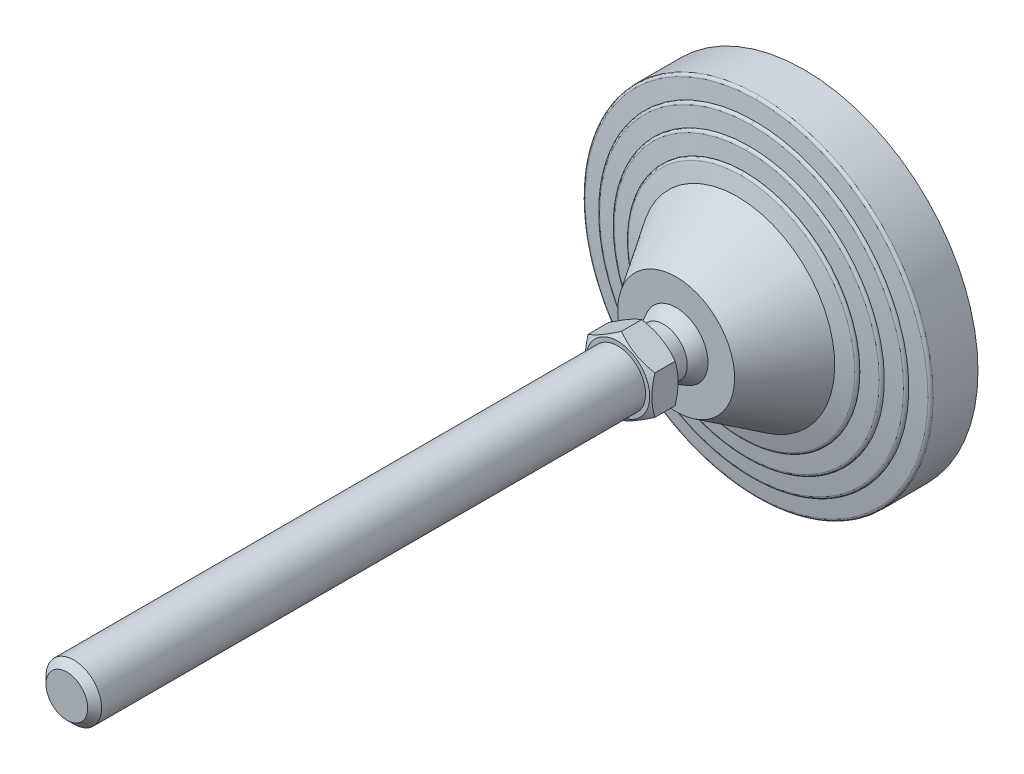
ISO-10303-21;
HEADER;
FILE_DESCRIPTION(('STEP AP214'),'2;1');
FILE_NAME('part.step','',(''),(''),'','','');
FILE_SCHEMA(('AUTOMOTIVE_DESIGN { 1 0 10303 214 1 1 1 1 }'));
ENDSEC;
DATA;
#1=APPLICATION_CONTEXT('core data for automotive mechanical design processes');
#2=APPLICATION_PROTOCOL_DEFINITION('international standard','automotive_design',2000,#1);
#3=PRODUCT_CONTEXT('',#1,'mechanical');
#4=PRODUCT('Part','Part','',(#3));
#5=PRODUCT_RELATED_PRODUCT_CATEGORY('part','',(#4));
#6=PRODUCT_DEFINITION_FORMATION('','',#4);
#7=PRODUCT_DEFINITION_CONTEXT('part definition',#1,'design');
#8=PRODUCT_DEFINITION('design','',#6,#7);
#9=PRODUCT_DEFINITION_SHAPE('','',#8);
#10=(LENGTH_UNIT() NAMED_UNIT(*) SI_UNIT(.MILLI.,.METRE.));
#11=(NAMED_UNIT(*) PLANE_ANGLE_UNIT() SI_UNIT($,.RADIAN.));
#12=(NAMED_UNIT(*) SI_UNIT($,.STERADIAN.) SOLID_ANGLE_UNIT());
#13=UNCERTAINTY_MEASURE_WITH_UNIT(LENGTH_MEASURE(1.E-05),#10,'distance_accuracy_value','');
#14=(GEOMETRIC_REPRESENTATION_CONTEXT(3) GLOBAL_UNCERTAINTY_ASSIGNED_CONTEXT((#13)) GLOBAL_UNIT_ASSIGNED_CONTEXT((#10,
#11,#12)) REPRESENTATION_CONTEXT('',''));
#15=CARTESIAN_POINT('',(0.,0.,0.));
#16=DIRECTION('',(0.,0.,1.));
#17=DIRECTION('',(1.,0.,0.));
#18=AXIS2_PLACEMENT_3D('',#15,#16,#17);
#19=CARTESIAN_POINT('',(-63.467641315,63.25,-1.76158091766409E-13));
#20=DIRECTION('',(0.,0.,1.));
#21=DIRECTION('',(0.,-1.,0.));
#22=AXIS2_PLACEMENT_3D('',#19,#20,#21);
#23=PLANE('',#22);
#24=CARTESIAN_POINT('',(0.,0.,0.));
#25=DIRECTION('',(0.,0.,-1.));
#26=DIRECTION('',(0.,1.,0.));
#27=AXIS2_PLACEMENT_3D('',#24,#25,#26);
#28=CIRCLE('',#27,62.5);
#29=CARTESIAN_POINT('',(0.,62.5,0.));
#30=VERTEX_POINT('',#29);
#31=EDGE_CURVE('E243',#30,#30,#28,.F.);
#32=ORIENTED_EDGE('',*,*,#31,.F.);
#33=EDGE_LOOP('',(#32));
#34=FACE_BOUND('',#33,.T.);
#35=ADVANCED_FACE('F14',(#34),#23,.F.);
#36=CARTESIAN_POINT('',(0.,0.,16.119206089));
#37=DIRECTION('',(0.,0.,-1.));
#38=DIRECTION('',(0.,1.,0.));
#39=AXIS2_PLACEMENT_3D('',#36,#37,#38);
#40=CYLINDRICAL_SURFACE('',#39,62.5);
#41=ORIENTED_EDGE('',*,*,#31,.T.);
#42=EDGE_LOOP('',(#41));
#43=FACE_BOUND('',#42,.T.);
#44=CARTESIAN_POINT('',(0.,0.,16.119206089));
#45=DIRECTION('',(0.,0.,1.));
#46=DIRECTION('',(0.,-1.,0.));
#47=AXIS2_PLACEMENT_3D('',#44,#45,#46);
#48=CIRCLE('',#47,62.5);
#49=CARTESIAN_POINT('',(-6.40952688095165E-09,-62.5,16.119206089));
#50=VERTEX_POINT('',#49);
#51=CARTESIAN_POINT('',(0.,62.5,16.119206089));
#52=VERTEX_POINT('',#51);
#53=EDGE_CURVE('E522',#50,#52,#48,.T.);
#54=ORIENTED_EDGE('',*,*,#53,.F.);
#55=CARTESIAN_POINT('',(0.,0.,16.119206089));
#56=DIRECTION('',(0.,0.,1.));
#57=DIRECTION('',(0.,-1.,0.));
#58=AXIS2_PLACEMENT_3D('',#55,#56,#57);
#59=CIRCLE('',#58,62.5);
#60=EDGE_CURVE('E245',#52,#50,#59,.T.);
#61=ORIENTED_EDGE('',*,*,#60,.F.);
#62=EDGE_LOOP('',(#54,#61));
#63=FACE_BOUND('',#62,.T.);
#64=ADVANCED_FACE('F387',(#43,#63),#40,.T.);
#65=CARTESIAN_POINT('',(0.,-62.5,16.119206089));
#66=CARTESIAN_POINT('',(-125.,-62.5,16.1192060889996));
#67=CARTESIAN_POINT('',(-125.,62.5,16.1192060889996));
#68=CARTESIAN_POINT('',(0.,62.5,16.119206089));
#69=CARTESIAN_POINT('',(0.,-62.5,16.647800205));
#70=CARTESIAN_POINT('',(-125.,-62.5,16.6478002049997));
#71=CARTESIAN_POINT('',(-125.,62.5,16.6478002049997));
#72=CARTESIAN_POINT('',(0.,62.5,16.647800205));
#73=CARTESIAN_POINT('',(0.,-62.1506185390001,17.044466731));
#74=CARTESIAN_POINT('',(-124.301237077,-62.150618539,17.0444667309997));
#75=CARTESIAN_POINT('',(-124.301237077,62.150618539,17.0444667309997));
#76=CARTESIAN_POINT('',(0.,62.1506185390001,17.044466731));
#77=CARTESIAN_POINT('',(0.,-61.62625428,17.111204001));
#78=CARTESIAN_POINT('',(-123.252508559,-61.6262542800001,17.1112040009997));
#79=CARTESIAN_POINT('',(-123.252508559,61.6262542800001,17.1112040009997));
#80=CARTESIAN_POINT('',(0.,61.62625428,17.111204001));
#81=(BOUNDED_SURFACE() B_SPLINE_SURFACE(3,3,((#65,#66,#67,#68),(#69,#70,#71,#72),(#73,#74,#75,
#76),(#77,#78,#79,#80)),.UNSPECIFIED.,.F.,.F.,.F.) B_SPLINE_SURFACE_WITH_KNOTS((4,4),(4,4),(0.,
1.),(0.,1.),.UNSPECIFIED.) GEOMETRIC_REPRESENTATION_ITEM() RATIONAL_B_SPLINE_SURFACE(((1.,
0.333333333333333,0.333333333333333,1.),(0.833611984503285,0.277870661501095,0.277870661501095,
0.833611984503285),(0.833611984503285,0.277870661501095,0.277870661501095,0.833611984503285),
(1.,0.333333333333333,0.333333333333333,1.))) REPRESENTATION_ITEM('') SURFACE());
#82=CARTESIAN_POINT('',(0.,62.5,16.119206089));
#83=CARTESIAN_POINT('',(0.,62.5,16.647800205));
#84=CARTESIAN_POINT('',(0.,62.1506185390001,17.044466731));
#85=CARTESIAN_POINT('',(0.,61.62625428,17.111204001));
#86=(BOUNDED_CURVE() B_SPLINE_CURVE(3,(#82,#83,#84,#85),.UNSPECIFIED.,.F.,
.F.) B_SPLINE_CURVE_WITH_KNOTS((4,4),(0.,1.),
.UNSPECIFIED.) CURVE() GEOMETRIC_REPRESENTATION_ITEM() RATIONAL_B_SPLINE_CURVE((1.,
0.833611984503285,0.833611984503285,1.)) REPRESENTATION_ITEM(''));
#87=CARTESIAN_POINT('',(0.,61.6262542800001,17.111204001));
#88=VERTEX_POINT('',#87);
#89=EDGE_CURVE('E513',#52,#88,#86,.T.);
#90=CARTESIAN_POINT('',(0.,-62.5,16.119206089));
#91=CARTESIAN_POINT('',(0.,-62.5,16.647800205));
#92=CARTESIAN_POINT('',(0.,-62.1506185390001,17.044466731));
#93=CARTESIAN_POINT('',(0.,-61.62625428,17.111204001));
#94=(BOUNDED_CURVE() B_SPLINE_CURVE(3,(#90,#91,#92,#93),.UNSPECIFIED.,.F.,
.F.) B_SPLINE_CURVE_WITH_KNOTS((4,4),(0.,1.),
.UNSPECIFIED.) CURVE() GEOMETRIC_REPRESENTATION_ITEM() RATIONAL_B_SPLINE_CURVE((1.,
0.833611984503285,0.833611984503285,1.)) REPRESENTATION_ITEM(''));
#95=CARTESIAN_POINT('',(-1.8959681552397E-08,-61.6262542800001,17.111204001));
#96=VERTEX_POINT('',#95);
#97=EDGE_CURVE('E248',#96,#50,#94,.F.);
#98=CARTESIAN_POINT('',(0.,0.,17.111204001));
#99=DIRECTION('',(0.,0.,-1.));
#100=DIRECTION('',(0.,1.,0.));
#101=AXIS2_PLACEMENT_3D('',#98,#99,#100);
#102=CIRCLE('',#101,61.62625428);
#103=EDGE_CURVE('E506',#88,#96,#102,.F.);
#104=ORIENTED_EDGE('',*,*,#89,.F.);
#105=ORIENTED_EDGE('',*,*,#60,.T.);
#106=ORIENTED_EDGE('',*,*,#97,.F.);
#107=ORIENTED_EDGE('',*,*,#103,.F.);
#108=EDGE_LOOP('',(#104,#105,#106,#107));
#109=FACE_BOUND('',#108,.T.);
#110=ADVANCED_FACE('F693',(#109),#81,.T.);
#111=CARTESIAN_POINT('',(0.,62.5,16.119206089));
#112=CARTESIAN_POINT('',(125.,62.5,16.1192060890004));
#113=CARTESIAN_POINT('',(125.,-62.5,16.1192060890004));
#114=CARTESIAN_POINT('',(0.,-62.5,16.119206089));
#115=CARTESIAN_POINT('',(0.,62.5,16.647800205));
#116=CARTESIAN_POINT('',(125.,62.5,16.6478002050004));
#117=CARTESIAN_POINT('',(125.,-62.5,16.6478002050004));
#118=CARTESIAN_POINT('',(0.,-62.5,16.647800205));
#119=CARTESIAN_POINT('',(0.,62.1506185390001,17.044466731));
#120=CARTESIAN_POINT('',(124.301237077,62.150618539,17.0444667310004));
#121=CARTESIAN_POINT('',(124.301237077,-62.150618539,17.0444667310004));
#122=CARTESIAN_POINT('',(0.,-62.1506185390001,17.044466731));
#123=CARTESIAN_POINT('',(0.,61.62625428,17.111204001));
#124=CARTESIAN_POINT('',(123.252508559,61.6262542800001,17.1112040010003));
#125=CARTESIAN_POINT('',(123.252508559,-61.6262542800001,17.1112040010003));
#126=CARTESIAN_POINT('',(0.,-61.62625428,17.111204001));
#127=(BOUNDED_SURFACE() B_SPLINE_SURFACE(3,3,((#111,#112,#113,#114),(#115,#116,#117,#118),(#119,
#120,#121,#122),(#123,#124,#125,#126)),.UNSPECIFIED.,.F.,.F.,
.F.) B_SPLINE_SURFACE_WITH_KNOTS((4,4),(4,4),(0.,1.),(0.,1.),
.UNSPECIFIED.) GEOMETRIC_REPRESENTATION_ITEM() RATIONAL_B_SPLINE_SURFACE(((1.,0.333333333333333,
0.333333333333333,1.),(0.833611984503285,0.277870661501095,0.277870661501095,0.833611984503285),
(0.833611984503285,0.277870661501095,0.277870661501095,0.833611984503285),(1.,0.333333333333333,
0.333333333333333,1.))) REPRESENTATION_ITEM('') SURFACE());
#128=CARTESIAN_POINT('',(0.,0.,17.111204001));
#129=DIRECTION('',(0.,0.,-1.));
#130=DIRECTION('',(0.,1.,0.));
#131=AXIS2_PLACEMENT_3D('',#128,#129,#130);
#132=CIRCLE('',#131,61.62625428);
#133=EDGE_CURVE('E512',#96,#88,#132,.F.);
#134=ORIENTED_EDGE('',*,*,#53,.T.);
#135=ORIENTED_EDGE('',*,*,#89,.T.);
#136=ORIENTED_EDGE('',*,*,#133,.F.);
#137=ORIENTED_EDGE('',*,*,#97,.T.);
#138=EDGE_LOOP('',(#134,#135,#136,#137));
#139=FACE_BOUND('',#138,.T.);
#140=ADVANCED_FACE('F229',(#139),#127,.T.);
#141=CARTESIAN_POINT('',(0.,0.,17.890909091));
#142=DIRECTION('',(0.,0.,-1.));
#143=DIRECTION('',(0.,1.,0.));
#144=AXIS2_PLACEMENT_3D('',#141,#142,#143);
#145=CONICAL_SURFACE('',#144,55.5,1.44420419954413);
#146=ORIENTED_EDGE('',*,*,#103,.T.);
#147=ORIENTED_EDGE('',*,*,#133,.T.);
#148=EDGE_LOOP('',(#146,#147));
#149=FACE_BOUND('',#148,.T.);
#150=CARTESIAN_POINT('',(-1.13831454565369E-08,-55.5,17.890909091));
#151=CARTESIAN_POINT('',(0.666810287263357,-55.5000058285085,17.890909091));
#152=CARTESIAN_POINT('',(1.33362158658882,-55.4879831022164,17.890909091));
#153=CARTESIAN_POINT('',(2.66828219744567,-55.4398527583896,17.890909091));
#154=CARTESIAN_POINT('',(3.33612903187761,-55.4036764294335,17.890909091));
#155=CARTESIAN_POINT('',(4.67008368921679,-55.3072108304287,17.890909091));
#156=CARTESIAN_POINT('',(5.33619149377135,-55.2469213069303,17.890909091));
#157=CARTESIAN_POINT('',(6.66630694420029,-55.1022519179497,17.890909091));
#158=CARTESIAN_POINT('',(7.33031261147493,-55.0178537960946,17.890909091));
#159=CARTESIAN_POINT('',(8.65488946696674,-54.8250946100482,17.890909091));
#160=CARTESIAN_POINT('',(9.31546019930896,-54.7167304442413,17.890909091));
#161=CARTESIAN_POINT('',(11.3032442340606,-54.3535835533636,17.8909090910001));
#162=CARTESIAN_POINT('',(12.6239565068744,-54.0621103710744,17.890909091));
#163=CARTESIAN_POINT('',(15.2407929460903,-53.383483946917,17.890909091));
#164=CARTESIAN_POINT('',(16.5369104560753,-52.9963051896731,17.890909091));
#165=CARTESIAN_POINT('',(19.0989356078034,-52.1278427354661,17.8909090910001));
#166=CARTESIAN_POINT('',(20.3648068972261,-51.6464516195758,17.8909090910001));
#167=CARTESIAN_POINT('',(22.857943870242,-50.5924539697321,17.8909090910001));
#168=CARTESIAN_POINT('',(24.0852091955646,-50.0198465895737,17.8909090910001));
#169=CARTESIAN_POINT('',(26.678667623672,-48.6922162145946,17.8909090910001));
#170=CARTESIAN_POINT('',(28.0374663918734,-47.9226902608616,17.8909090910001));
#171=CARTESIAN_POINT('',(30.6855194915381,-46.2718474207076,17.8909090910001));
#172=CARTESIAN_POINT('',(31.9747656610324,-45.3905174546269,17.8909090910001));
#173=CARTESIAN_POINT('',(34.4745529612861,-43.5222940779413,17.8909090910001));
#174=CARTESIAN_POINT('',(35.6850872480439,-42.535391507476,17.8909090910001));
#175=CARTESIAN_POINT('',(38.0186685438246,-40.4631409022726,17.8909090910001));
#176=CARTESIAN_POINT('',(39.1417181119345,-39.3777957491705,17.8909090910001));
#177=CARTESIAN_POINT('',(41.2923479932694,-37.1163936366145,17.8909090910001));
#178=CARTESIAN_POINT('',(42.3199319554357,-35.9403401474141,17.8909090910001));
#179=CARTESIAN_POINT('',(44.2723789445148,-33.5058382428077,17.8909090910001));
#180=CARTESIAN_POINT('',(45.1972412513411,-32.2473892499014,17.8909090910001));
#181=CARTESIAN_POINT('',(46.9376312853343,-29.65709574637,17.8909090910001));
#182=CARTESIAN_POINT('',(47.7531628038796,-28.3252537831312,17.8909090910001));
#183=CARTESIAN_POINT('',(49.2691299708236,-25.5976050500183,17.8909090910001));
#184=CARTESIAN_POINT('',(49.9695658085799,-24.201798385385,17.8909090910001));
#185=CARTESIAN_POINT('',(51.250370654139,-21.3561258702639,17.8909090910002));
#186=CARTESIAN_POINT('',(51.8307383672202,-19.9062594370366,17.8909090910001));
#187=CARTESIAN_POINT('',(52.8672716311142,-16.9627885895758,17.8909090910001));
#188=CARTESIAN_POINT('',(53.3234371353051,-15.4691841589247,17.8909090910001));
#189=CARTESIAN_POINT('',(54.1083272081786,-12.4488388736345,17.8909090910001));
#190=CARTESIAN_POINT('',(54.4370503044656,-10.9220976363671,17.8909090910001));
#191=CARTESIAN_POINT('',(54.9647110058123,-7.84634988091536,17.8909090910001));
#192=CARTESIAN_POINT('',(55.1636486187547,-6.29734336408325,17.8909090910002));
#193=CARTESIAN_POINT('',(55.4303245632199,-3.18807153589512,17.8909090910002));
#194=CARTESIAN_POINT('',(55.4980623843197,-1.62780618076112,17.8909090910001));
#195=CARTESIAN_POINT('',(55.5018556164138,1.49288460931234,17.8909090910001));
#196=CARTESIAN_POINT('',(55.4379110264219,3.05331004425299,17.8909090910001));
#197=CARTESIAN_POINT('',(55.1787965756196,6.16319684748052,17.8909090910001));
#198=CARTESIAN_POINT('',(54.9836292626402,7.71265842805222,17.8909090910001));
#199=CARTESIAN_POINT('',(54.4634594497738,10.7896325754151,17.8909090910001));
#200=CARTESIAN_POINT('',(54.1384569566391,12.3171451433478,17.8909090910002));
#201=CARTESIAN_POINT('',(53.360933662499,15.3393372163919,17.8909090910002));
#202=CARTESIAN_POINT('',(52.9084149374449,16.8340172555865,17.8909090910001));
#203=CARTESIAN_POINT('',(51.8790738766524,19.7799443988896,17.8909090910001));
#204=CARTESIAN_POINT('',(51.3022515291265,21.2311914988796,17.8909090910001));
#205=CARTESIAN_POINT('',(50.0283709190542,24.0800097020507,17.8909090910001));
#206=CARTESIAN_POINT('',(49.3313064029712,25.477578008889,17.8909090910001));
#207=CARTESIAN_POINT('',(47.821917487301,28.2090226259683,17.8909090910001));
#208=CARTESIAN_POINT('',(47.0095931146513,29.5428989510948,17.8909090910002));
#209=CARTESIAN_POINT('',(45.2754391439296,32.1375097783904,17.8909090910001));
#210=CARTESIAN_POINT('',(44.3536065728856,33.3982422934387,17.8909090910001));
#211=CARTESIAN_POINT('',(42.4069961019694,35.8375708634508,17.8909090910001));
#212=CARTESIAN_POINT('',(41.3822180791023,37.0161668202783,17.8909090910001));
#213=CARTESIAN_POINT('',(39.2371577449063,39.2826945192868,17.8909090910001));
#214=CARTESIAN_POINT('',(38.1168855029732,40.3706357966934,17.8909090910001));
#215=CARTESIAN_POINT('',(35.7885615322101,42.4483529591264,17.8909090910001));
#216=CARTESIAN_POINT('',(34.5805102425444,43.4381293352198,17.8909090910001));
#217=CARTESIAN_POINT('',(32.5014047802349,44.9999063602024,17.8909090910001));
#218=CARTESIAN_POINT('',(31.6521856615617,45.6012216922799,17.8909090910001));
#219=CARTESIAN_POINT('',(29.9212415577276,46.755223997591,17.8909090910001));
#220=CARTESIAN_POINT('',(29.039516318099,47.3079105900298,17.8909090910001));
#221=CARTESIAN_POINT('',(27.2463975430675,48.3628576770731,17.8909090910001));
#222=CARTESIAN_POINT('',(26.3350034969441,48.8651173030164,17.8909090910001));
#223=CARTESIAN_POINT('',(24.4853750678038,49.8176528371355,17.8909090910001));
#224=CARTESIAN_POINT('',(23.5471392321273,50.2679259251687,17.8909090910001));
#225=CARTESIAN_POINT('',(21.6468644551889,51.1150215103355,17.8909090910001));
#226=CARTESIAN_POINT('',(20.6848259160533,51.5118449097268,17.8909090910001));
#227=CARTESIAN_POINT('',(18.7400290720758,52.2507726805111,17.8909090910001));
#228=CARTESIAN_POINT('',(17.7572723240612,52.5928811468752,17.8909090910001));
#229=CARTESIAN_POINT('',(15.8636176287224,53.1929617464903,17.890909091));
#230=CARTESIAN_POINT('',(14.9542390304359,53.4557406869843,17.890909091));
#231=CARTESIAN_POINT('',(13.1232854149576,53.9344479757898,17.890909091));
#232=CARTESIAN_POINT('',(12.2017111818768,54.1503793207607,17.890909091));
#233=CARTESIAN_POINT('',(10.3487557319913,54.5348378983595,17.890909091));
#234=CARTESIAN_POINT('',(9.4173747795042,54.7033664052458,17.890909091));
#235=CARTESIAN_POINT('',(7.54728204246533,54.9925789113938,17.890909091));
#236=CARTESIAN_POINT('',(6.60857079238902,55.1132663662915,17.890909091));
#237=CARTESIAN_POINT('',(4.72616569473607,55.3064952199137,17.890909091));
#238=CARTESIAN_POINT('',(3.78247163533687,55.3790345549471,17.890909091));
#239=CARTESIAN_POINT('',(1.89251924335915,55.4758006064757,17.890909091));
#240=CARTESIAN_POINT('',(0.94626067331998,55.5000226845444,17.890909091));
#241=CARTESIAN_POINT('',(-1.66121529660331E-09,55.5,17.890909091));
#242=B_SPLINE_CURVE_WITH_KNOTS('',3,(#150,#151,#152,#153,#154,#155,#156,#157,#158,#159,#160,
#161,#162,#163,#164,#165,#166,#167,#168,#169,#170,#171,#172,#173,#174,#175,#176,#177,#178,#179,
#180,#181,#182,#183,#184,#185,#186,#187,#188,#189,#190,#191,#192,#193,#194,#195,#196,#197,#198,
#199,#200,#201,#202,#203,#204,#205,#206,#207,#208,#209,#210,#211,#212,#213,#214,#215,#216,#217,
#218,#219,#220,#221,#222,#223,#224,#225,#226,#227,#228,#229,#230,#231,#232,#233,#234,#235,#236,
#237,#238,#239,#240,#241),.UNSPECIFIED.,.F.,.F.,(4,2,2,2,2,2,2,2,2,2,2,2,2,2,2,2,2,2,2,2,2,2,2,
2,2,2,2,2,2,2,2,2,2,2,2,2,2,2,2,2,2,2,2,2,2,4),(0.,2.00032482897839,4.00636450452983,
6.01242526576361,8.02000917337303,10.0278530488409,14.0813911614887,18.1360111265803,
22.1952813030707,26.2545891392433,30.9336173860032,35.6131935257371,40.2931760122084,
44.9730215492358,49.6526881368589,54.3323875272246,59.0119245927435,63.6914539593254,
68.3710337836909,73.0506153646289,77.7302510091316,82.4098863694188,87.0895399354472,
91.7691935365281,96.448756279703,101.128318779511,105.80780510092,110.487291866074,
115.167022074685,119.846751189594,124.526607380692,129.206469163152,133.885838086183,
138.56518359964,141.685351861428,144.805544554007,147.925790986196,151.046206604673,
154.16656954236,157.286698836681,160.12523673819,162.963593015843,165.801872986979,
168.639947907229,171.478144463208,174.316613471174),.UNSPECIFIED.);
#243=CARTESIAN_POINT('',(-1.13832817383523E-08,-55.5,17.895966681));
#244=VERTEX_POINT('',#243);
#245=CARTESIAN_POINT('',(-1.66123179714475E-09,55.5,17.895966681));
#246=VERTEX_POINT('',#245);
#247=EDGE_CURVE('E210',#244,#246,#242,.T.);
#248=ORIENTED_EDGE('',*,*,#247,.F.);
#249=CARTESIAN_POINT('',(-1.66122951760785E-09,55.5,17.890909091));
#250=CARTESIAN_POINT('',(-0.666810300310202,55.5000058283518,17.890909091));
#251=CARTESIAN_POINT('',(-1.33362159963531,55.4879831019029,17.890909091));
#252=CARTESIAN_POINT('',(-2.66828221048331,55.4398527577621,17.890909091));
#253=CARTESIAN_POINT('',(-3.33612904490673,55.403676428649,17.890909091));
#254=CARTESIAN_POINT('',(-4.67008370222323,55.3072108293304,17.890909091));
#255=CARTESIAN_POINT('',(-5.33619150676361,55.2469213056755,17.890909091));
#256=CARTESIAN_POINT('',(-6.66630695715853,55.1022519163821,17.890909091));
#257=CARTESIAN_POINT('',(-7.33031262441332,55.0178537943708,17.890909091));
#258=CARTESIAN_POINT('',(-8.6548894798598,54.8250946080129,17.890909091));
#259=CARTESIAN_POINT('',(-9.31546021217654,54.7167304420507,17.890909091));
#260=CARTESIAN_POINT('',(-11.3032442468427,54.3535835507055,17.8909090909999));
#261=CARTESIAN_POINT('',(-12.623956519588,54.0621103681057,17.890909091));
#262=CARTESIAN_POINT('',(-15.2407929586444,53.3834839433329,17.890909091));
#263=CARTESIAN_POINT('',(-16.5369104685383,52.9963051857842,17.890909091));
#264=CARTESIAN_POINT('',(-19.0989356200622,52.1278427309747,17.8909090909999));
#265=CARTESIAN_POINT('',(-20.3648069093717,51.6464516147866,17.8909090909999));
#266=CARTESIAN_POINT('',(-22.8579438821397,50.5924539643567,17.8909090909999));
#267=CARTESIAN_POINT('',(-24.0852092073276,50.0198465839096,17.890909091));
#268=CARTESIAN_POINT('',(-26.6786676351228,48.6922162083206,17.8909090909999));
#269=CARTESIAN_POINT('',(-28.0374664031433,47.9226902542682,17.8909090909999));
#270=CARTESIAN_POINT('',(-30.6855195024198,46.2718474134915,17.8909090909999));
#271=CARTESIAN_POINT('',(-31.9747656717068,45.3905174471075,17.8909090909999));
#272=CARTESIAN_POINT('',(-34.4745529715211,43.522294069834,17.8909090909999));
#273=CARTESIAN_POINT('',(-35.6850872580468,42.5353914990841,17.8909090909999));
#274=CARTESIAN_POINT('',(-38.0186685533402,40.4631408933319,17.8909090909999));
#275=CARTESIAN_POINT('',(-39.1417181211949,39.3777957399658,17.8909090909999));
#276=CARTESIAN_POINT('',(-41.292348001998,37.1163936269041,17.8909090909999));
#277=CARTESIAN_POINT('',(-42.3199319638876,35.9403401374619,17.8909090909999));
#278=CARTESIAN_POINT('',(-44.2723789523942,33.5058382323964,17.8909090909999));
#279=CARTESIAN_POINT('',(-45.1972412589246,32.2473892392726,17.8909090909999));
#280=CARTESIAN_POINT('',(-46.9376312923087,29.6570957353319,17.8909090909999));
#281=CARTESIAN_POINT('',(-47.7531628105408,28.3252537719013,17.8909090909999));
#282=CARTESIAN_POINT('',(-49.2691299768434,25.5976050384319,17.8909090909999));
#283=CARTESIAN_POINT('',(-49.9695658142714,24.2017983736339,17.8909090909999));
#284=CARTESIAN_POINT('',(-51.2503706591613,21.3561258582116,17.8909090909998));
#285=CARTESIAN_POINT('',(-51.8307383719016,19.9062594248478,17.8909090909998));
#286=CARTESIAN_POINT('',(-52.8672716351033,16.9627885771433,17.8909090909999));
#287=CARTESIAN_POINT('',(-53.3234371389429,15.4691841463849,17.8909090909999));
#288=CARTESIAN_POINT('',(-54.1083272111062,12.4488388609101,17.8909090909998));
#289=CARTESIAN_POINT('',(-54.4370503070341,10.9220976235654,17.8909090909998));
#290=CARTESIAN_POINT('',(-54.9647110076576,7.84634986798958,17.8909090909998));
#291=CARTESIAN_POINT('',(-55.1636486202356,6.2973433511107,17.8909090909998));
#292=CARTESIAN_POINT('',(-55.4303245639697,3.1880715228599,17.8909090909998));
#293=CARTESIAN_POINT('',(-55.4980623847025,1.62780616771,17.8909090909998));
#294=CARTESIAN_POINT('',(-55.5018556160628,-1.49288462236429,17.8909090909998));
#295=CARTESIAN_POINT('',(-55.4379110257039,-3.05331005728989,17.8909090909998));
#296=CARTESIAN_POINT('',(-55.1787965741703,-6.16319686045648,17.8909090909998));
#297=CARTESIAN_POINT('',(-54.9836292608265,-7.71265844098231,17.8909090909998));
#298=CARTESIAN_POINT('',(-54.4634594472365,-10.789632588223,17.8909090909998));
#299=CARTESIAN_POINT('',(-54.1384569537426,-12.3171451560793,17.8909090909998));
#300=CARTESIAN_POINT('',(-53.3609336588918,-15.3393372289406,17.8909090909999));
#301=CARTESIAN_POINT('',(-52.9084149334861,-16.8340172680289,17.8909090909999));
#302=CARTESIAN_POINT('',(-51.8790738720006,-19.7799444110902,17.8909090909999));
#303=CARTESIAN_POINT('',(-51.3022515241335,-21.2311915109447,17.8909090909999));
#304=CARTESIAN_POINT('',(-50.0283709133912,-24.0800097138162,17.8909090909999));
#305=CARTESIAN_POINT('',(-49.3313063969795,-25.4775780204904,17.8909090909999));
#306=CARTESIAN_POINT('',(-47.8219174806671,-28.2090226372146,17.8909090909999));
#307=CARTESIAN_POINT('',(-47.0095931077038,-29.5428989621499,17.8909090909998));
#308=CARTESIAN_POINT('',(-45.2754391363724,-32.1375097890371,17.8909090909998));
#309=CARTESIAN_POINT('',(-44.3536065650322,-33.3982423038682,17.8909090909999));
#310=CARTESIAN_POINT('',(-42.4069960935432,-35.8375708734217,17.8909090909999));
#311=CARTESIAN_POINT('',(-41.3822180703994,-37.0161668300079,17.8909090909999));
#312=CARTESIAN_POINT('',(-39.2371577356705,-39.2826945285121,17.8909090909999));
#313=CARTESIAN_POINT('',(-38.1168854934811,-40.3706358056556,17.8909090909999));
#314=CARTESIAN_POINT('',(-35.7885615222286,-42.448352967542,17.8909090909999));
#315=CARTESIAN_POINT('',(-34.5805102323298,-43.4381293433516,17.8909090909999));
#316=CARTESIAN_POINT('',(-32.5014047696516,-44.9999063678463,17.8909090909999));
#317=CARTESIAN_POINT('',(-31.652185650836,-45.6012216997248,17.8909090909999));
#318=CARTESIAN_POINT('',(-29.9212415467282,-46.7552240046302,17.8909090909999));
#319=CARTESIAN_POINT('',(-29.0395163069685,-47.3079105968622,17.8909090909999));
#320=CARTESIAN_POINT('',(-27.2463975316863,-48.362857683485,17.8909090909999));
#321=CARTESIAN_POINT('',(-26.3350034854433,-48.8651173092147,17.8909090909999));
#322=CARTESIAN_POINT('',(-24.4853750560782,-49.8176528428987,17.8909090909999));
#323=CARTESIAN_POINT('',(-23.5471392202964,-50.2679259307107,17.8909090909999));
#324=CARTESIAN_POINT('',(-21.6468644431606,-51.1150215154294,17.8909090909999));
#325=CARTESIAN_POINT('',(-20.6848259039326,-51.5118449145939,17.8909090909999));
#326=CARTESIAN_POINT('',(-18.7400290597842,-52.2507726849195,17.8909090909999));
#327=CARTESIAN_POINT('',(-17.7572723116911,-52.5928811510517,17.8909090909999));
#328=CARTESIAN_POINT('',(-15.8636176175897,-53.1929617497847,17.890909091));
#329=CARTESIAN_POINT('',(-14.9542390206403,-53.4557406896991,17.890909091));
#330=CARTESIAN_POINT('',(-13.1232854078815,-53.9344479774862,17.890909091));
#331=CARTESIAN_POINT('',(-12.2017111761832,-54.1503793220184,17.890909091));
#332=CARTESIAN_POINT('',(-10.348755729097,-54.5348378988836,17.890909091));
#333=CARTESIAN_POINT('',(-9.41737477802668,-54.7033664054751,17.890909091));
#334=CARTESIAN_POINT('',(-7.54728204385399,-54.9925789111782,17.890909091));
#335=CARTESIAN_POINT('',(-6.60857079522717,-55.1132663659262,17.890909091));
#336=CARTESIAN_POINT('',(-4.72616570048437,-55.3064952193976,17.890909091));
#337=CARTESIAN_POINT('',(-3.78247164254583,-55.3790345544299,17.890909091));
#338=CARTESIAN_POINT('',(-1.89251925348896,-55.4758006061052,17.890909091));
#339=CARTESIAN_POINT('',(-0.94626068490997,-55.5000226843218,17.890909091));
#340=CARTESIAN_POINT('',(-1.13832810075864E-08,-55.5,17.890909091));
#341=B_SPLINE_CURVE_WITH_KNOTS('',3,(#249,#250,#251,#252,#253,#254,#255,#256,#257,#258,#259,
#260,#261,#262,#263,#264,#265,#266,#267,#268,#269,#270,#271,#272,#273,#274,#275,#276,#277,#278,
#279,#280,#281,#282,#283,#284,#285,#286,#287,#288,#289,#290,#291,#292,#293,#294,#295,#296,#297,
#298,#299,#300,#301,#302,#303,#304,#305,#306,#307,#308,#309,#310,#311,#312,#313,#314,#315,#316,
#317,#318,#319,#320,#321,#322,#323,#324,#325,#326,#327,#328,#329,#330,#331,#332,#333,#334,#335,
#336,#337,#338,#339,#340),.UNSPECIFIED.,.F.,.F.,(4,2,2,2,2,2,2,2,2,2,2,2,2,2,2,2,2,2,2,2,2,2,2,
2,2,2,2,2,2,2,2,2,2,2,2,2,2,2,2,2,2,2,2,2,2,4),(0.,2.0003248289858,4.00636450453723,
6.01242526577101,8.02000917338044,10.0278530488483,14.0813911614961,18.1360111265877,
22.1952813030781,26.2545891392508,30.9336173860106,35.6131935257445,40.2931760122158,
44.9730215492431,49.6526881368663,54.332387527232,59.0119245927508,63.6914539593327,
68.3710337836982,73.0506153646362,77.730251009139,82.4098863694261,87.0895399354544,
91.7691935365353,96.4487562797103,101.128318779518,105.807805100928,110.487291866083,
115.167022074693,119.846751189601,124.526607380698,129.206469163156,133.885838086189,
138.565183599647,141.685351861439,144.805544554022,147.925790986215,151.04620660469,
154.166569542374,157.286698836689,160.125236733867,162.963593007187,165.801872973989,
168.639947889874,171.47814444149,174.316613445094),.UNSPECIFIED.);
#342=EDGE_CURVE('E222',#246,#244,#341,.T.);
#343=ORIENTED_EDGE('',*,*,#342,.F.);
#344=EDGE_LOOP('',(#248,#343));
#345=FACE_BOUND('',#344,.T.);
#346=ADVANCED_FACE('F224',(#149,#345),#145,.T.);
#347=CARTESIAN_POINT('',(0.,-55.5,17.887804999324));
#348=CARTESIAN_POINT('',(-111.,-55.5000000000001,17.8878049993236));
#349=CARTESIAN_POINT('',(-111.,55.5000000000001,17.8878049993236));
#350=CARTESIAN_POINT('',(0.,55.5,17.887804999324));
#351=CARTESIAN_POINT('',(0.,-55.5,17.892211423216));
#352=CARTESIAN_POINT('',(-111.,-55.5000000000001,17.8922114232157));
#353=CARTESIAN_POINT('',(-111.,55.5000000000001,17.8922114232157));
#354=CARTESIAN_POINT('',(0.,55.5,17.892211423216));
#355=CARTESIAN_POINT('',(0.,-55.5,17.896617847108));
#356=CARTESIAN_POINT('',(-111.,-55.5000000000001,17.8966178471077));
#357=CARTESIAN_POINT('',(-111.,55.5000000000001,17.8966178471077));
#358=CARTESIAN_POINT('',(0.,55.5,17.896617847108));
#359=CARTESIAN_POINT('',(0.,-55.5,17.901024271));
#360=CARTESIAN_POINT('',(-111.,-55.5000000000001,17.9010242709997));
#361=CARTESIAN_POINT('',(-111.,55.5000000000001,17.9010242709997));
#362=CARTESIAN_POINT('',(0.,55.5,17.901024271));
#363=CARTESIAN_POINT('',(0.,-55.5,18.429618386));
#364=CARTESIAN_POINT('',(-111.,-55.5000000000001,18.4296183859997));
#365=CARTESIAN_POINT('',(-111.,55.5000000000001,18.4296183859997));
#366=CARTESIAN_POINT('',(0.,55.5,18.429618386));
#367=CARTESIAN_POINT('',(0.,-55.1506185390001,18.826284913));
#368=CARTESIAN_POINT('',(-110.301237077,-55.150618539,18.8262849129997));
#369=CARTESIAN_POINT('',(-110.301237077,55.150618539,18.8262849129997));
#370=CARTESIAN_POINT('',(0.,55.1506185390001,18.826284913));
#371=CARTESIAN_POINT('',(0.,-54.62625428,18.893022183));
#372=CARTESIAN_POINT('',(-109.252508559,-54.62625428,18.8930221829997));
#373=CARTESIAN_POINT('',(-109.252508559,54.62625428,18.8930221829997));
#374=CARTESIAN_POINT('',(0.,54.62625428,18.893022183));
#375=(BOUNDED_SURFACE() B_SPLINE_SURFACE(3,3,((#347,#348,#349,#350),(#351,#352,#353,#354),(#355,
#356,#357,#358),(#359,#360,#361,#362),(#363,#364,#365,#366),(#367,#368,#369,#370),(#371,#372,
#373,#374)),.UNSPECIFIED.,.F.,.F.,.F.) B_SPLINE_SURFACE_WITH_KNOTS((4,3,4),(4,4),(-0.01,0.,1.),
(0.,1.),.UNSPECIFIED.) GEOMETRIC_REPRESENTATION_ITEM() RATIONAL_B_SPLINE_SURFACE(((1.,
0.333333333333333,0.333333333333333,1.),(1.,0.333333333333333,0.333333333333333,1.),(1.,
0.333333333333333,0.333333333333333,1.),(1.,0.333333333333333,0.333333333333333,1.),
(0.833611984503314,0.277870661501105,0.277870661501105,0.833611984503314),(0.833611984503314,
0.277870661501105,0.277870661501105,0.833611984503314),(1.,0.333333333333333,0.333333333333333,1.))) REPRESENTATION_ITEM('') SURFACE());
#376=CARTESIAN_POINT('',(0.,55.5,17.901024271));
#377=CARTESIAN_POINT('',(0.,55.5,18.429618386));
#378=CARTESIAN_POINT('',(0.,55.1506185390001,18.826284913));
#379=CARTESIAN_POINT('',(0.,54.62625428,18.893022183));
#380=(BOUNDED_CURVE() B_SPLINE_CURVE(3,(#376,#377,#378,#379),.UNSPECIFIED.,.F.,
.F.) B_SPLINE_CURVE_WITH_KNOTS((4,4),(0.,1.),
.UNSPECIFIED.) CURVE() GEOMETRIC_REPRESENTATION_ITEM() RATIONAL_B_SPLINE_CURVE((1.,
0.833611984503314,0.833611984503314,1.)) REPRESENTATION_ITEM(''));
#381=CARTESIAN_POINT('',(0.,54.6262542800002,18.8930221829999));
#382=VERTEX_POINT('',#381);
#383=EDGE_CURVE('E213',#246,#382,#380,.T.);
#384=CARTESIAN_POINT('',(0.,-55.5,17.901024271));
#385=CARTESIAN_POINT('',(0.,-55.5,18.429618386));
#386=CARTESIAN_POINT('',(0.,-55.1506185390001,18.826284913));
#387=CARTESIAN_POINT('',(0.,-54.62625428,18.893022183));
#388=(BOUNDED_CURVE() B_SPLINE_CURVE(3,(#384,#385,#386,#387),.UNSPECIFIED.,.F.,
.F.) B_SPLINE_CURVE_WITH_KNOTS((4,4),(0.,1.),
.UNSPECIFIED.) CURVE() GEOMETRIC_REPRESENTATION_ITEM() RATIONAL_B_SPLINE_CURVE((1.,
0.833611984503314,0.833611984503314,1.)) REPRESENTATION_ITEM(''));
#389=CARTESIAN_POINT('',(-1.68061004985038E-08,-54.6262542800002,18.8930221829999));
#390=VERTEX_POINT('',#389);
#391=EDGE_CURVE('E214',#390,#244,#388,.F.);
#392=CARTESIAN_POINT('',(0.,0.,18.8930221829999));
#393=DIRECTION('',(0.,0.,-1.));
#394=DIRECTION('',(0.,1.,0.));
#395=AXIS2_PLACEMENT_3D('',#392,#393,#394);
#396=CIRCLE('',#395,54.62625428);
#397=EDGE_CURVE('E478',#382,#390,#396,.F.);
#398=ORIENTED_EDGE('',*,*,#383,.F.);
#399=ORIENTED_EDGE('',*,*,#342,.T.);
#400=ORIENTED_EDGE('',*,*,#391,.F.);
#401=ORIENTED_EDGE('',*,*,#397,.F.);
#402=EDGE_LOOP('',(#398,#399,#400,#401));
#403=FACE_BOUND('',#402,.T.);
#404=ADVANCED_FACE('F228',(#403),#375,.T.);
#405=CARTESIAN_POINT('',(0.,55.5,17.887804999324));
#406=CARTESIAN_POINT('',(111.,55.5000000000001,17.8878049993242));
#407=CARTESIAN_POINT('',(111.,-55.5000000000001,17.8878049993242));
#408=CARTESIAN_POINT('',(0.,-55.5,17.887804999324));
#409=CARTESIAN_POINT('',(0.,55.5,17.892211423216));
#410=CARTESIAN_POINT('',(111.,55.5000000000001,17.8922114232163));
#411=CARTESIAN_POINT('',(111.,-55.5000000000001,17.8922114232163));
#412=CARTESIAN_POINT('',(0.,-55.5,17.892211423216));
#413=CARTESIAN_POINT('',(0.,55.5,17.896617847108));
#414=CARTESIAN_POINT('',(111.,55.5000000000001,17.8966178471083));
#415=CARTESIAN_POINT('',(111.,-55.5000000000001,17.8966178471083));
#416=CARTESIAN_POINT('',(0.,-55.5,17.896617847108));
#417=CARTESIAN_POINT('',(0.,55.5,17.901024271));
#418=CARTESIAN_POINT('',(111.,55.5000000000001,17.9010242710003));
#419=CARTESIAN_POINT('',(111.,-55.5000000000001,17.9010242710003));
#420=CARTESIAN_POINT('',(0.,-55.5,17.901024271));
#421=CARTESIAN_POINT('',(0.,55.5,18.429618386));
#422=CARTESIAN_POINT('',(111.,55.5000000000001,18.4296183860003));
#423=CARTESIAN_POINT('',(111.,-55.5000000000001,18.4296183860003));
#424=CARTESIAN_POINT('',(0.,-55.5,18.429618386));
#425=CARTESIAN_POINT('',(0.,55.1506185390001,18.826284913));
#426=CARTESIAN_POINT('',(110.301237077,55.150618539,18.8262849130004));
#427=CARTESIAN_POINT('',(110.301237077,-55.150618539,18.8262849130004));
#428=CARTESIAN_POINT('',(0.,-55.1506185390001,18.826284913));
#429=CARTESIAN_POINT('',(0.,54.62625428,18.893022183));
#430=CARTESIAN_POINT('',(109.252508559,54.62625428,18.8930221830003));
#431=CARTESIAN_POINT('',(109.252508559,-54.62625428,18.8930221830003));
#432=CARTESIAN_POINT('',(0.,-54.62625428,18.893022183));
#433=(BOUNDED_SURFACE() B_SPLINE_SURFACE(3,3,((#405,#406,#407,#408),(#409,#410,#411,#412),(#413,
#414,#415,#416),(#417,#418,#419,#420),(#421,#422,#423,#424),(#425,#426,#427,#428),(#429,#430,
#431,#432)),.UNSPECIFIED.,.F.,.F.,.F.) B_SPLINE_SURFACE_WITH_KNOTS((4,3,4),(4,4),(-0.01,0.,1.),
(0.,1.),.UNSPECIFIED.) GEOMETRIC_REPRESENTATION_ITEM() RATIONAL_B_SPLINE_SURFACE(((1.,
0.333333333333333,0.333333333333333,1.),(1.,0.333333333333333,0.333333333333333,1.),(1.,
0.333333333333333,0.333333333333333,1.),(1.,0.333333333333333,0.333333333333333,1.),
(0.833611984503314,0.277870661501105,0.277870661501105,0.833611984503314),(0.833611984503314,
0.277870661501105,0.277870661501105,0.833611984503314),(1.,0.333333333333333,0.333333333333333,1.))) REPRESENTATION_ITEM('') SURFACE());
#434=CARTESIAN_POINT('',(0.,0.,18.8930221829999));
#435=DIRECTION('',(0.,0.,-1.));
#436=DIRECTION('',(0.,1.,0.));
#437=AXIS2_PLACEMENT_3D('',#434,#435,#436);
#438=CIRCLE('',#437,54.62625428);
#439=EDGE_CURVE('E484',#390,#382,#438,.F.);
#440=ORIENTED_EDGE('',*,*,#247,.T.);
#441=ORIENTED_EDGE('',*,*,#383,.T.);
#442=ORIENTED_EDGE('',*,*,#439,.F.);
#443=ORIENTED_EDGE('',*,*,#391,.T.);
#444=EDGE_LOOP('',(#440,#441,#442,#443));
#445=FACE_BOUND('',#444,.T.);
#446=ADVANCED_FACE('F194',(#445),#433,.T.);
#447=CARTESIAN_POINT('',(0.,0.,19.672727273));
#448=DIRECTION('',(0.,0.,-1.));
#449=DIRECTION('',(0.,1.,0.));
#450=AXIS2_PLACEMENT_3D('',#447,#448,#449);
#451=CONICAL_SURFACE('',#450,48.5,1.44420419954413);
#452=ORIENTED_EDGE('',*,*,#397,.T.);
#453=ORIENTED_EDGE('',*,*,#439,.T.);
#454=EDGE_LOOP('',(#452,#453));
#455=FACE_BOUND('',#454,.T.);
#456=CARTESIAN_POINT('',(-9.94742308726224E-09,-48.5,19.672727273));
#457=CARTESIAN_POINT('',(0.333415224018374,-48.4999999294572,19.672727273));
#458=CARTESIAN_POINT('',(0.666820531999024,-48.4965617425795,19.672727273));
#459=CARTESIAN_POINT('',(1.33352786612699,-48.4828103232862,19.672727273));
#460=CARTESIAN_POINT('',(1.66682987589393,-48.4724962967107,19.672727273));
#461=CARTESIAN_POINT('',(2.66872204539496,-48.4311451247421,19.672727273));
#462=CARTESIAN_POINT('',(3.33691272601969,-48.3896987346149,19.672727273));
#463=CARTESIAN_POINT('',(4.67104276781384,-48.2791827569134,19.672727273));
#464=CARTESIAN_POINT('',(5.33698191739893,-48.2101106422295,19.672727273));
#465=CARTESIAN_POINT('',(6.66612914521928,-48.0443714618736,19.672727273));
#466=CARTESIAN_POINT('',(7.32933372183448,-47.9476761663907,19.672727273));
#467=CARTESIAN_POINT('',(8.65121670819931,-47.7268868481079,19.672727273));
#468=CARTESIAN_POINT('',(9.30989445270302,-47.6027888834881,19.672727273));
#469=CARTESIAN_POINT('',(11.2942742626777,-47.1861322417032,19.6727272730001));
#470=CARTESIAN_POINT('',(12.6113745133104,-46.8513167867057,19.672727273));
#471=CARTESIAN_POINT('',(15.2131663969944,-46.0722804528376,19.672727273));
#472=CARTESIAN_POINT('',(16.4978453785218,-45.6280175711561,19.672727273));
#473=CARTESIAN_POINT('',(19.0268967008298,-44.6326754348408,19.6727272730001));
#474=CARTESIAN_POINT('',(20.2712210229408,-44.0814740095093,19.6727272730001));
#475=CARTESIAN_POINT('',(22.7090353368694,-42.8765478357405,19.6727272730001));
#476=CARTESIAN_POINT('',(23.9025301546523,-42.2228328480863,19.672727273));
#477=CARTESIAN_POINT('',(26.2339069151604,-40.8153372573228,19.6727272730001));
#478=CARTESIAN_POINT('',(27.3716102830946,-40.0612608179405,19.6727272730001));
#479=CARTESIAN_POINT('',(29.5794657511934,-38.4599142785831,19.6727272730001));
#480=CARTESIAN_POINT('',(30.6496160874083,-37.6126417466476,19.6727272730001));
#481=CARTESIAN_POINT('',(32.7144313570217,-35.8311972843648,19.6727272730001));
#482=CARTESIAN_POINT('',(33.709117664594,-34.8970501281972,19.6727272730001));
#483=CARTESIAN_POINT('',(35.6162650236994,-32.9482983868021,19.6727272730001));
#484=CARTESIAN_POINT('',(36.528726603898,-31.9336943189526,19.6727272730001));
#485=CARTESIAN_POINT('',(38.265047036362,-29.8311130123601,19.6727272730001));
#486=CARTESIAN_POINT('',(39.0888956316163,-28.7431273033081,19.6727272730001));
#487=CARTESIAN_POINT('',(40.6420135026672,-26.5016202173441,19.6727272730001));
#488=CARTESIAN_POINT('',(41.3712826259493,-25.3480987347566,19.6727272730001));
#489=CARTESIAN_POINT('',(42.7300878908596,-22.9836659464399,19.6727272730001));
#490=CARTESIAN_POINT('',(43.3596192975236,-21.7727519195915,19.6727272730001));
#491=CARTESIAN_POINT('',(44.5144313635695,-19.3021944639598,19.6727272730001));
#492=CARTESIAN_POINT('',(45.0397120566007,-18.0425510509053,19.6727272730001));
#493=CARTESIAN_POINT('',(45.9822772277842,-15.4835203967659,19.6727272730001));
#494=CARTESIAN_POINT('',(46.399564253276,-14.1841340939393,19.6727272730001));
#495=CARTESIAN_POINT('',(47.1231916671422,-11.5548271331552,19.6727272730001));
#496=CARTESIAN_POINT('',(47.4295320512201,-10.2249064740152,19.6727272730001));
#497=CARTESIAN_POINT('',(47.9290880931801,-7.5439866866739,19.6727272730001));
#498=CARTESIAN_POINT('',(48.1223038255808,-6.19298757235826,19.6727272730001));
#499=CARTESIAN_POINT('',(48.3942372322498,-3.47951480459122,19.6727272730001));
#500=CARTESIAN_POINT('',(48.4729549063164,-2.1170411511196,19.6727272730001));
#501=CARTESIAN_POINT('',(48.5153327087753,0.609703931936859,19.6727272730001));
#502=CARTESIAN_POINT('',(48.4789920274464,1.97397537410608,19.6727272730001));
#503=CARTESIAN_POINT('',(48.2915097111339,4.6946071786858,19.6727272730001));
#504=CARTESIAN_POINT('',(48.1403680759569,6.05096754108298,19.6727272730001));
#505=CARTESIAN_POINT('',(47.7243611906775,8.74611604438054,19.6727272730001));
#506=CARTESIAN_POINT('',(47.4594974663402,10.0849044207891,19.6727272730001));
#507=CARTESIAN_POINT('',(46.8179296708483,12.7354096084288,19.6727272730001));
#508=CARTESIAN_POINT('',(46.441225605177,14.0471264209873,19.6727272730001));
#509=CARTESIAN_POINT('',(45.5786575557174,16.6341561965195,19.6727272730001));
#510=CARTESIAN_POINT('',(45.0927941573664,17.90946935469,19.6727272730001));
#511=CARTESIAN_POINT('',(44.0153602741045,20.4146329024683,19.6727272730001));
#512=CARTESIAN_POINT('',(43.4237897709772,21.6444832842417,19.6727272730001));
#513=CARTESIAN_POINT('',(42.13913189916,24.0500069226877,19.6727272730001));
#514=CARTESIAN_POINT('',(41.4460420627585,25.2256788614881,19.6727272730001));
#515=CARTESIAN_POINT('',(39.963283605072,27.5144547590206,19.6727272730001));
#516=CARTESIAN_POINT('',(39.1736150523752,28.6275587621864,19.6727272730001));
#517=CARTESIAN_POINT('',(37.5033313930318,30.7832641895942,19.6727272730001));
#518=CARTESIAN_POINT('',(36.6227180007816,31.8258669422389,19.6727272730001));
#519=CARTESIAN_POINT('',(34.7767800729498,33.8331893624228,19.6727272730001));
#520=CARTESIAN_POINT('',(33.8114552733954,34.7979087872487,19.6727272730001));
#521=CARTESIAN_POINT('',(31.8029804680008,36.6425966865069,19.6727272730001));
#522=CARTESIAN_POINT('',(30.7598292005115,37.5225637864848,19.6727272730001));
#523=CARTESIAN_POINT('',(28.6030073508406,39.191539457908,19.6727272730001));
#524=CARTESIAN_POINT('',(27.4893376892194,39.9805492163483,19.672727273));
#525=CARTESIAN_POINT('',(25.5812150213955,41.2150302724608,19.6727272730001));
#526=CARTESIAN_POINT('',(24.8040020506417,41.687387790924,19.6727272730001));
#527=CARTESIAN_POINT('',(23.2241951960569,42.5877109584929,19.6727272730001));
#528=CARTESIAN_POINT('',(22.4216008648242,43.0156758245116,19.6727272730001));
#529=CARTESIAN_POINT('',(20.7935946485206,43.8258285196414,19.6727272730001));
#530=CARTESIAN_POINT('',(19.968181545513,44.2080138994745,19.6727272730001));
#531=CARTESIAN_POINT('',(18.2974514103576,44.9252645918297,19.672727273));
#532=CARTESIAN_POINT('',(17.4521411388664,45.2603456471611,19.672727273));
#533=CARTESIAN_POINT('',(15.7440847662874,45.882457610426,19.672727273));
#534=CARTESIAN_POINT('',(14.8813396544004,46.1694912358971,19.672727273));
#535=CARTESIAN_POINT('',(13.1412443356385,46.6945749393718,19.672727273));
#536=CARTESIAN_POINT('',(12.2638974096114,46.9326358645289,19.6727272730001));
#537=CARTESIAN_POINT('',(10.7597151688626,47.2957357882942,19.672727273));
#538=CARTESIAN_POINT('',(10.1358813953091,47.4333417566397,19.672727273));
#539=CARTESIAN_POINT('',(8.88335895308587,47.6837886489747,19.672727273));
#540=CARTESIAN_POINT('',(8.2546711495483,47.7966338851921,19.672727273));
#541=CARTESIAN_POINT('',(6.99338768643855,47.9973988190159,19.672727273));
#542=CARTESIAN_POINT('',(6.36079236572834,48.0853206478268,19.672727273));
#543=CARTESIAN_POINT('',(5.09345547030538,48.2360176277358,19.672727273));
#544=CARTESIAN_POINT('',(4.45871780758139,48.298825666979,19.672727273));
#545=CARTESIAN_POINT('',(3.18720376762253,48.3993639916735,19.672727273));
#546=CARTESIAN_POINT('',(2.55042721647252,48.4370920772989,19.672727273));
#547=CARTESIAN_POINT('',(1.27576743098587,48.4874158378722,19.672727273));
#548=CARTESIAN_POINT('',(0.637884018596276,48.5000070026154,19.672727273));
#549=CARTESIAN_POINT('',(-1.45170018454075E-09,48.5,19.672727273));
#550=B_SPLINE_CURVE_WITH_KNOTS('',3,(#456,#457,#458,#459,#460,#461,#462,#463,#464,#465,#466,
#467,#468,#469,#470,#471,#472,#473,#474,#475,#476,#477,#478,#479,#480,#481,#482,#483,#484,#485,
#486,#487,#488,#489,#490,#491,#492,#493,#494,#495,#496,#497,#498,#499,#500,#501,#502,#503,#504,
#505,#506,#507,#508,#509,#510,#511,#512,#513,#514,#515,#516,#517,#518,#519,#520,#521,#522,#523,
#524,#525,#526,#527,#528,#529,#530,#531,#532,#533,#534,#535,#536,#537,#538,#539,#540,#541,#542,
#543,#544,#545,#546,#547,#548,#549),.UNSPECIFIED.,.F.,.F.,(4,2,2,2,2,2,2,2,2,2,2,2,2,2,2,2,2,2,
2,2,2,2,2,2,2,2,2,2,2,2,2,2,2,2,2,2,2,2,2,2,2,2,2,2,2,2,4),(0.,1.00020813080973,
2.00053180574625,4.00833049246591,6.01631288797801,8.02635474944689,10.0366859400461,
14.1084255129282,18.1817301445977,22.2597159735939,26.3373137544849,30.4272089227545,
34.5172108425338,38.6060499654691,42.6948627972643,46.784148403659,50.8734406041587,
54.9629268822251,59.052411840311,63.1418003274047,67.2311889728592,71.3205749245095,
75.409960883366,79.49937562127,83.5887903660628,87.6781502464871,91.7675099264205,
95.8568476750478,99.946186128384,104.03562400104,108.125058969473,112.214416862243,
116.303787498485,120.393224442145,124.482608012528,127.209786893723,129.937013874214,
132.664386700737,135.390845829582,138.117150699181,140.842851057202,142.758881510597,
144.674578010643,146.590110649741,148.503126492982,150.416310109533,152.329836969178),.UNSPECIFIED.);
#551=CARTESIAN_POINT('',(-9.94756372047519E-09,-48.5,19.677784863));
#552=VERTEX_POINT('',#551);
#553=CARTESIAN_POINT('',(-1.45171827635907E-09,48.5,19.677784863));
#554=VERTEX_POINT('',#553);
#555=EDGE_CURVE('E168',#552,#554,#550,.T.);
#556=ORIENTED_EDGE('',*,*,#555,.F.);
#557=CARTESIAN_POINT('',(-1.45171628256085E-09,48.5,19.672727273));
#558=CARTESIAN_POINT('',(-0.333415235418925,48.4999999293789,19.672727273));
#559=CARTESIAN_POINT('',(-0.666820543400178,48.4965617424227,19.672727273));
#560=CARTESIAN_POINT('',(-1.33352787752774,48.4828103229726,19.672727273));
#561=CARTESIAN_POINT('',(-1.66682988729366,48.4724962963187,19.672727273));
#562=CARTESIAN_POINT('',(-2.66872205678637,48.4311451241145,19.672727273));
#563=CARTESIAN_POINT('',(-3.33691273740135,48.3896987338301,19.672727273));
#564=CARTESIAN_POINT('',(-4.67104277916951,48.2791827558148,19.672727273));
#565=CARTESIAN_POINT('',(-5.33698192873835,48.2101106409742,19.672727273));
#566=CARTESIAN_POINT('',(-6.66612915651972,48.0443714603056,19.672727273));
#567=CARTESIAN_POINT('',(-7.32933373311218,47.9476761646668,19.672727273));
#568=CARTESIAN_POINT('',(-8.65121671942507,47.7268868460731,19.672727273));
#569=CARTESIAN_POINT('',(-9.30989446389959,47.6027888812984,19.672727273));
#570=CARTESIAN_POINT('',(-11.2942742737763,47.1861322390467,19.6727272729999));
#571=CARTESIAN_POINT('',(-12.6113745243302,46.8513167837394,19.672727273));
#572=CARTESIAN_POINT('',(-15.213166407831,46.0722804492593,19.672727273));
#573=CARTESIAN_POINT('',(-16.4978453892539,45.6280175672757,19.672727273));
#574=CARTESIAN_POINT('',(-19.0268967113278,44.6326754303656,19.6727272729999));
#575=CARTESIAN_POINT('',(-20.2712210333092,44.0814740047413,19.6727272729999));
#576=CARTESIAN_POINT('',(-22.7090353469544,42.8765478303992,19.6727272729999));
#577=CARTESIAN_POINT('',(-23.9025301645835,42.2228328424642,19.672727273));
#578=CARTESIAN_POINT('',(-26.2339069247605,40.8153372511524,19.6727272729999));
#579=CARTESIAN_POINT('',(-27.3716102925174,40.0612608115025,19.6727272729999));
#580=CARTESIAN_POINT('',(-29.5794657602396,38.4599142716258,19.6727272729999));
#581=CARTESIAN_POINT('',(-30.6496160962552,37.6126417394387,19.6727272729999));
#582=CARTESIAN_POINT('',(-32.7144313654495,35.8311972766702,19.6727272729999));
#583=CARTESIAN_POINT('',(-33.7091176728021,34.8970501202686,19.6727272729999));
#584=CARTESIAN_POINT('',(-35.6162650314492,32.9482983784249,19.6727272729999));
#585=CARTESIAN_POINT('',(-36.5287266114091,31.9336943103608,19.6727272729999));
#586=CARTESIAN_POINT('',(-38.2650470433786,29.8311130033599,19.6727272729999));
#587=CARTESIAN_POINT('',(-39.088895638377,28.7431272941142,19.6727272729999));
#588=CARTESIAN_POINT('',(-40.6420135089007,26.5016202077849,19.6727272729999));
#589=CARTESIAN_POINT('',(-41.3712826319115,25.3480987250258,19.6727272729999));
#590=CARTESIAN_POINT('',(-42.7300878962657,22.9836659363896,19.6727272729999));
#591=CARTESIAN_POINT('',(-43.3596193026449,21.7727519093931,19.6727272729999));
#592=CARTESIAN_POINT('',(-44.5144313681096,19.3021944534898,19.6727272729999));
#593=CARTESIAN_POINT('',(-45.0397120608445,18.0425510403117,19.6727272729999));
#594=CARTESIAN_POINT('',(-45.9822772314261,15.4835203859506,19.6727272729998));
#595=CARTESIAN_POINT('',(-46.3995642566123,14.1841340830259,19.6727272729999));
#596=CARTESIAN_POINT('',(-47.12319166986,11.5548271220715,19.6727272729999));
#597=CARTESIAN_POINT('',(-47.4295320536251,10.2249064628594,19.6727272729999));
#598=CARTESIAN_POINT('',(-47.9290880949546,7.54398667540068,19.6727272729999));
#599=CARTESIAN_POINT('',(-48.1223038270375,6.19298756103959,19.6727272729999));
#600=CARTESIAN_POINT('',(-48.3942372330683,3.47951479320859,19.6727272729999));
#601=CARTESIAN_POINT('',(-48.4729549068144,2.11704113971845,19.6727272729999));
#602=CARTESIAN_POINT('',(-48.515332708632,-0.609703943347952,19.6727272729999));
#603=CARTESIAN_POINT('',(-48.4789920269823,-1.9739753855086,19.6727272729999));
#604=CARTESIAN_POINT('',(-48.2915097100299,-4.69460719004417,19.6727272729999));
#605=CARTESIAN_POINT('',(-48.1403680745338,-6.05096755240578,19.6727272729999));
#606=CARTESIAN_POINT('',(-47.7243611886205,-8.74611605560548,19.6727272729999));
#607=CARTESIAN_POINT('',(-47.4594974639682,-10.0849044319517,19.6727272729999));
#608=CARTESIAN_POINT('',(-46.817929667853,-12.7354096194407,19.6727272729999));
#609=CARTESIAN_POINT('',(-46.4412256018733,-14.0471264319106,19.6727272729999));
#610=CARTESIAN_POINT('',(-45.5786575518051,-16.6341562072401,19.6727272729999));
#611=CARTESIAN_POINT('',(-45.092794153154,-17.9094693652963,19.6727272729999));
#612=CARTESIAN_POINT('',(-44.0153602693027,-20.4146329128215,19.6727272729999));
#613=CARTESIAN_POINT('',(-43.4237897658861,-21.6444832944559,19.6727272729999));
#614=CARTESIAN_POINT('',(-42.1391318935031,-24.0500069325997,19.6727272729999));
#615=CARTESIAN_POINT('',(-41.4460420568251,-25.225678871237,19.6727272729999));
#616=CARTESIAN_POINT('',(-39.9632835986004,-27.5144547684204,19.6727272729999));
#617=CARTESIAN_POINT('',(-39.1736150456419,-28.6275587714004,19.6727272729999));
#618=CARTESIAN_POINT('',(-37.5033313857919,-30.7832641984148,19.6727272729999));
#619=CARTESIAN_POINT('',(-36.6227179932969,-31.8258669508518,19.6727272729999));
#620=CARTESIAN_POINT('',(-34.7767800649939,-33.8331893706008,19.6727272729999));
#621=CARTESIAN_POINT('',(-33.811455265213,-34.7979087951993,19.6727272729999));
#622=CARTESIAN_POINT('',(-31.8029804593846,-36.6425966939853,19.6727272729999));
#623=CARTESIAN_POINT('',(-30.7598291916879,-37.5225637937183,19.6727272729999));
#624=CARTESIAN_POINT('',(-28.6030073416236,-39.1915394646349,19.6727272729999));
#625=CARTESIAN_POINT('',(-27.4893376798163,-39.9805492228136,19.672727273));
#626=CARTESIAN_POINT('',(-25.5812150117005,-41.2150302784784,19.6727272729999));
#627=CARTESIAN_POINT('',(-24.8040020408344,-41.6873877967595,19.6727272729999));
#628=CARTESIAN_POINT('',(-23.2241951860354,-42.5877109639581,19.6727272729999));
#629=CARTESIAN_POINT('',(-22.4216008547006,-43.0156758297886,19.6727272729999));
#630=CARTESIAN_POINT('',(-20.7935946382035,-43.8258285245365,19.6727272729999));
#631=CARTESIAN_POINT('',(-19.9681815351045,-44.2080139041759,19.6727272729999));
#632=CARTESIAN_POINT('',(-18.2974513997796,-44.925264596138,19.6727272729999));
#633=CARTESIAN_POINT('',(-17.4521411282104,-45.26034565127,19.6727272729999));
#634=CARTESIAN_POINT('',(-15.7440847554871,-45.8824576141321,19.672727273));
#635=CARTESIAN_POINT('',(-14.8813396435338,-46.1694912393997,19.672727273));
#636=CARTESIAN_POINT('',(-13.1412443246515,-46.6945749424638,19.672727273));
#637=CARTESIAN_POINT('',(-12.2638973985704,-46.932635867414,19.6727272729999));
#638=CARTESIAN_POINT('',(-10.759715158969,-47.2957357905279,19.672727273));
#639=CARTESIAN_POINT('',(-10.1358813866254,-47.4333417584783,19.672727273));
#640=CARTESIAN_POINT('',(-8.8833589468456,-47.6837886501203,19.672727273));
#641=CARTESIAN_POINT('',(-8.25467114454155,-47.7966338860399,19.672727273));
#642=CARTESIAN_POINT('',(-6.99338768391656,-47.9973988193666,19.672727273));
#643=CARTESIAN_POINT('',(-6.36079236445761,-48.0853206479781,19.672727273));
#644=CARTESIAN_POINT('',(-5.09345547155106,-48.2360176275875,19.672727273));
#645=CARTESIAN_POINT('',(-4.45871781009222,-48.2988256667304,19.672727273));
#646=CARTESIAN_POINT('',(-3.18720377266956,-48.3993639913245,19.672727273));
#647=CARTESIAN_POINT('',(-2.55042722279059,-48.4370920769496,19.672727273));
#648=CARTESIAN_POINT('',(-1.27576743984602,-48.4874158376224,19.672727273));
#649=CARTESIAN_POINT('',(-0.637884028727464,-48.5000070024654,19.672727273));
#650=CARTESIAN_POINT('',(-9.94756398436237E-09,-48.5,19.672727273));
#651=B_SPLINE_CURVE_WITH_KNOTS('',3,(#557,#558,#559,#560,#561,#562,#563,#564,#565,#566,#567,
#568,#569,#570,#571,#572,#573,#574,#575,#576,#577,#578,#579,#580,#581,#582,#583,#584,#585,#586,
#587,#588,#589,#590,#591,#592,#593,#594,#595,#596,#597,#598,#599,#600,#601,#602,#603,#604,#605,
#606,#607,#608,#609,#610,#611,#612,#613,#614,#615,#616,#617,#618,#619,#620,#621,#622,#623,#624,
#625,#626,#627,#628,#629,#630,#631,#632,#633,#634,#635,#636,#637,#638,#639,#640,#641,#642,#643,
#644,#645,#646,#647,#648,#649,#650),.UNSPECIFIED.,.F.,.F.,(4,2,2,2,2,2,2,2,2,2,2,2,2,2,2,2,2,2,
2,2,2,2,2,2,2,2,2,2,2,2,2,2,2,2,2,2,2,2,2,2,2,2,2,2,2,2,4),(0.,1.00020813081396,
2.00053180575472,4.00833049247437,6.01631288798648,8.02635474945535,10.0366859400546,
14.1084255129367,18.1817301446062,22.2597159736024,26.3373137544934,30.427208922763,
34.5172108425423,38.6060499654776,42.6948627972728,46.7841484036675,50.8734406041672,
54.9629268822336,59.0524118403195,63.1418003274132,67.2311889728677,71.320574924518,
75.4099608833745,79.4993756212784,83.5887903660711,87.6781502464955,91.767509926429,
95.8568476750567,99.9461861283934,104.035624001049,108.125058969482,112.21441686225,
116.30378749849,120.393224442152,124.482608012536,127.209786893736,129.937013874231,
132.664386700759,135.3908458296,138.117150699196,140.84285105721,142.758881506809,
144.674578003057,146.590110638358,148.503126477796,150.416310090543,152.329836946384),.UNSPECIFIED.);
#652=EDGE_CURVE('E181',#554,#552,#651,.T.);
#653=ORIENTED_EDGE('',*,*,#652,.F.);
#654=EDGE_LOOP('',(#556,#653));
#655=FACE_BOUND('',#654,.T.);
#656=ADVANCED_FACE('F189',(#455,#655),#451,.T.);
#657=CARTESIAN_POINT('',(0.,-48.5,19.669623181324));
#658=CARTESIAN_POINT('',(-97.0000000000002,-48.5,19.6696231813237));
#659=CARTESIAN_POINT('',(-97.0000000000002,48.5,19.6696231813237));
#660=CARTESIAN_POINT('',(0.,48.5,19.669623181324));
#661=CARTESIAN_POINT('',(0.,-48.5,19.6740296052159));
#662=CARTESIAN_POINT('',(-97.0000000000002,-48.5,19.6740296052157));
#663=CARTESIAN_POINT('',(-97.0000000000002,48.5,19.6740296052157));
#664=CARTESIAN_POINT('',(0.,48.5,19.6740296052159));
#665=CARTESIAN_POINT('',(0.,-48.5,19.678436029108));
#666=CARTESIAN_POINT('',(-97.0000000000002,-48.5,19.6784360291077));
#667=CARTESIAN_POINT('',(-97.0000000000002,48.5,19.6784360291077));
#668=CARTESIAN_POINT('',(0.,48.5,19.678436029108));
#669=CARTESIAN_POINT('',(0.,-48.5,19.682842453));
#670=CARTESIAN_POINT('',(-97.0000000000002,-48.5,19.6828424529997));
#671=CARTESIAN_POINT('',(-97.0000000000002,48.5,19.6828424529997));
#672=CARTESIAN_POINT('',(0.,48.5,19.682842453));
#673=CARTESIAN_POINT('',(0.,-48.5,20.211436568));
#674=CARTESIAN_POINT('',(-97.,-48.5,20.2114365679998));
#675=CARTESIAN_POINT('',(-97.,48.5,20.2114365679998));
#676=CARTESIAN_POINT('',(0.,48.5,20.211436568));
#677=CARTESIAN_POINT('',(0.,-48.150618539,20.608103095));
#678=CARTESIAN_POINT('',(-96.3012370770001,-48.150618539,20.6081030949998));
#679=CARTESIAN_POINT('',(-96.3012370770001,48.150618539,20.6081030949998));
#680=CARTESIAN_POINT('',(0.,48.150618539,20.608103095));
#681=CARTESIAN_POINT('',(0.,-47.62625428,20.674840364));
#682=CARTESIAN_POINT('',(-95.252508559,-47.6262542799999,20.6748403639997));
#683=CARTESIAN_POINT('',(-95.252508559,47.6262542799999,20.6748403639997));
#684=CARTESIAN_POINT('',(0.,47.62625428,20.674840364));
#685=(BOUNDED_SURFACE() B_SPLINE_SURFACE(3,3,((#657,#658,#659,#660),(#661,#662,#663,#664),(#665,
#666,#667,#668),(#669,#670,#671,#672),(#673,#674,#675,#676),(#677,#678,#679,#680),(#681,#682,
#683,#684)),.UNSPECIFIED.,.F.,.F.,.F.) B_SPLINE_SURFACE_WITH_KNOTS((4,3,4),(4,4),(-0.01,0.,1.),
(0.,1.),.UNSPECIFIED.) GEOMETRIC_REPRESENTATION_ITEM() RATIONAL_B_SPLINE_SURFACE(((1.,
0.333333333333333,0.333333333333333,1.),(1.,0.333333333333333,0.333333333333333,1.),(1.,
0.333333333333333,0.333333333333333,1.),(1.,0.333333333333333,0.333333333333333,1.),
(0.833611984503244,0.277870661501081,0.277870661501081,0.833611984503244),(0.833611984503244,
0.277870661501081,0.277870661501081,0.833611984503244),(1.,0.333333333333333,0.333333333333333,1.))) REPRESENTATION_ITEM('') SURFACE());
#686=CARTESIAN_POINT('',(0.,48.5,19.682842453));
#687=CARTESIAN_POINT('',(0.,48.5,20.211436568));
#688=CARTESIAN_POINT('',(0.,48.150618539,20.608103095));
#689=CARTESIAN_POINT('',(0.,47.62625428,20.674840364));
#690=(BOUNDED_CURVE() B_SPLINE_CURVE(3,(#686,#687,#688,#689),.UNSPECIFIED.,.F.,
.F.) B_SPLINE_CURVE_WITH_KNOTS((4,4),(0.,1.),
.UNSPECIFIED.) CURVE() GEOMETRIC_REPRESENTATION_ITEM() RATIONAL_B_SPLINE_CURVE((1.,
0.833611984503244,0.833611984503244,1.)) REPRESENTATION_ITEM(''));
#691=CARTESIAN_POINT('',(0.,47.62625428,20.674840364));
#692=VERTEX_POINT('',#691);
#693=EDGE_CURVE('E171',#554,#692,#690,.T.);
#694=CARTESIAN_POINT('',(0.,-48.5,19.682842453));
#695=CARTESIAN_POINT('',(0.,-48.5,20.211436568));
#696=CARTESIAN_POINT('',(0.,-48.150618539,20.608103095));
#697=CARTESIAN_POINT('',(0.,-47.62625428,20.674840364));
#698=(BOUNDED_CURVE() B_SPLINE_CURVE(3,(#694,#695,#696,#697),.UNSPECIFIED.,.F.,
.F.) B_SPLINE_CURVE_WITH_KNOTS((4,4),(0.,1.),
.UNSPECIFIED.) CURVE() GEOMETRIC_REPRESENTATION_ITEM() RATIONAL_B_SPLINE_CURVE((1.,
0.833611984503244,0.833611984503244,1.)) REPRESENTATION_ITEM(''));
#699=CARTESIAN_POINT('',(-1.46525194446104E-08,-47.62625428,20.674840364));
#700=VERTEX_POINT('',#699);
#701=EDGE_CURVE('E172',#700,#552,#698,.F.);
#702=CARTESIAN_POINT('',(0.,0.,20.674840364));
#703=DIRECTION('',(0.,0.,-1.));
#704=DIRECTION('',(0.,1.,0.));
#705=AXIS2_PLACEMENT_3D('',#702,#703,#704);
#706=CIRCLE('',#705,47.62625428);
#707=EDGE_CURVE('E443',#692,#700,#706,.F.);
#708=ORIENTED_EDGE('',*,*,#693,.F.);
#709=ORIENTED_EDGE('',*,*,#652,.T.);
#710=ORIENTED_EDGE('',*,*,#701,.F.);
#711=ORIENTED_EDGE('',*,*,#707,.F.);
#712=EDGE_LOOP('',(#708,#709,#710,#711));
#713=FACE_BOUND('',#712,.T.);
#714=ADVANCED_FACE('F193',(#713),#685,.T.);
#715=CARTESIAN_POINT('',(0.,48.5,19.669623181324));
#716=CARTESIAN_POINT('',(97.,48.5,19.6696231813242));
#717=CARTESIAN_POINT('',(97.,-48.5,19.6696231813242));
#718=CARTESIAN_POINT('',(0.,-48.5,19.669623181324));
#719=CARTESIAN_POINT('',(0.,48.5,19.6740296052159));
#720=CARTESIAN_POINT('',(97.,48.5,19.6740296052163));
#721=CARTESIAN_POINT('',(97.,-48.5,19.6740296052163));
#722=CARTESIAN_POINT('',(0.,-48.5,19.6740296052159));
#723=CARTESIAN_POINT('',(0.,48.5,19.678436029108));
#724=CARTESIAN_POINT('',(97.,48.5,19.6784360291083));
#725=CARTESIAN_POINT('',(97.,-48.5,19.6784360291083));
#726=CARTESIAN_POINT('',(0.,-48.5,19.678436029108));
#727=CARTESIAN_POINT('',(0.,48.5,19.682842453));
#728=CARTESIAN_POINT('',(97.,48.5,19.6828424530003));
#729=CARTESIAN_POINT('',(97.,-48.5,19.6828424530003));
#730=CARTESIAN_POINT('',(0.,-48.5,19.682842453));
#731=CARTESIAN_POINT('',(0.,48.5,20.211436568));
#732=CARTESIAN_POINT('',(97.,48.5,20.2114365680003));
#733=CARTESIAN_POINT('',(97.,-48.5,20.2114365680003));
#734=CARTESIAN_POINT('',(0.,-48.5,20.211436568));
#735=CARTESIAN_POINT('',(0.,48.150618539,20.608103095));
#736=CARTESIAN_POINT('',(96.3012370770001,48.150618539,20.6081030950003));
#737=CARTESIAN_POINT('',(96.3012370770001,-48.150618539,20.6081030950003));
#738=CARTESIAN_POINT('',(0.,-48.150618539,20.608103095));
#739=CARTESIAN_POINT('',(0.,47.62625428,20.674840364));
#740=CARTESIAN_POINT('',(95.252508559,47.6262542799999,20.6748403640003));
#741=CARTESIAN_POINT('',(95.252508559,-47.6262542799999,20.6748403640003));
#742=CARTESIAN_POINT('',(0.,-47.62625428,20.674840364));
#743=(BOUNDED_SURFACE() B_SPLINE_SURFACE(3,3,((#715,#716,#717,#718),(#719,#720,#721,#722),(#723,
#724,#725,#726),(#727,#728,#729,#730),(#731,#732,#733,#734),(#735,#736,#737,#738),(#739,#740,
#741,#742)),.UNSPECIFIED.,.F.,.F.,.F.) B_SPLINE_SURFACE_WITH_KNOTS((4,3,4),(4,4),(-0.01,0.,1.),
(0.,1.),.UNSPECIFIED.) GEOMETRIC_REPRESENTATION_ITEM() RATIONAL_B_SPLINE_SURFACE(((1.,
0.333333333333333,0.333333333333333,1.),(1.,0.333333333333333,0.333333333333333,1.),(1.,
0.333333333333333,0.333333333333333,1.),(1.,0.333333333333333,0.333333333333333,1.),
(0.833611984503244,0.277870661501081,0.277870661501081,0.833611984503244),(0.833611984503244,
0.277870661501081,0.277870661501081,0.833611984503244),(1.,0.333333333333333,0.333333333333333,1.))) REPRESENTATION_ITEM('') SURFACE());
#744=CARTESIAN_POINT('',(0.,0.,20.674840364));
#745=DIRECTION('',(0.,0.,-1.));
#746=DIRECTION('',(0.,1.,0.));
#747=AXIS2_PLACEMENT_3D('',#744,#745,#746);
#748=CIRCLE('',#747,47.62625428);
#749=EDGE_CURVE('E449',#700,#692,#748,.F.);
#750=ORIENTED_EDGE('',*,*,#555,.T.);
#751=ORIENTED_EDGE('',*,*,#693,.T.);
#752=ORIENTED_EDGE('',*,*,#749,.F.);
#753=ORIENTED_EDGE('',*,*,#701,.T.);
#754=EDGE_LOOP('',(#750,#751,#752,#753));
#755=FACE_BOUND('',#754,.T.);
#756=ADVANCED_FACE('F183',(#755),#743,.T.);
#757=CARTESIAN_POINT('',(0.,0.,21.454545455));
#758=DIRECTION('',(0.,0.,-1.));
#759=DIRECTION('',(0.,1.,0.));
#760=AXIS2_PLACEMENT_3D('',#757,#758,#759);
#761=CONICAL_SURFACE('',#760,41.5,1.4442041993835);
#762=ORIENTED_EDGE('',*,*,#707,.T.);
#763=ORIENTED_EDGE('',*,*,#749,.T.);
#764=EDGE_LOOP('',(#762,#763));
#765=FACE_BOUND('',#764,.T.);
#766=CARTESIAN_POINT('',(0.,0.,21.454545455));
#767=DIRECTION('',(0.,0.,-1.));
#768=DIRECTION('',(0.,1.,0.));
#769=AXIS2_PLACEMENT_3D('',#766,#767,#768);
#770=CIRCLE('',#769,41.5);
#771=CARTESIAN_POINT('',(0.,41.5,21.454545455));
#772=VERTEX_POINT('',#771);
#773=EDGE_CURVE('E447',#772,#772,#770,.F.);
#774=ORIENTED_EDGE('',*,*,#773,.F.);
#775=EDGE_LOOP('',(#774));
#776=FACE_BOUND('',#775,.T.);
#777=ADVANCED_FACE('F431',(#765,#776),#761,.T.);
#778=CARTESIAN_POINT('',(0.,0.,21.568111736));
#779=DIRECTION('',(0.,0.,-1.));
#780=DIRECTION('',(0.,1.,0.));
#781=AXIS2_PLACEMENT_3D('',#778,#779,#780);
#782=CYLINDRICAL_SURFACE('',#781,41.5);
#783=ORIENTED_EDGE('',*,*,#773,.T.);
#784=EDGE_LOOP('',(#783));
#785=FACE_BOUND('',#784,.T.);
#786=CARTESIAN_POINT('',(0.,0.,21.568111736));
#787=DIRECTION('',(0.,0.,1.));
#788=DIRECTION('',(0.,-1.,0.));
#789=AXIS2_PLACEMENT_3D('',#786,#787,#788);
#790=CIRCLE('',#789,41.5);
#791=CARTESIAN_POINT('',(-4.2559560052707E-09,-41.5,21.568111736));
#792=VERTEX_POINT('',#791);
#793=CARTESIAN_POINT('',(0.,41.5,21.568111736));
#794=VERTEX_POINT('',#793);
#795=EDGE_CURVE('E585',#792,#794,#790,.T.);
#796=ORIENTED_EDGE('',*,*,#795,.F.);
#797=CARTESIAN_POINT('',(0.,0.,21.568111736));
#798=DIRECTION('',(0.,0.,1.));
#799=DIRECTION('',(0.,-1.,0.));
#800=AXIS2_PLACEMENT_3D('',#797,#798,#799);
#801=CIRCLE('',#800,41.5);
#802=EDGE_CURVE('E448',#794,#792,#801,.T.);
#803=ORIENTED_EDGE('',*,*,#802,.F.);
#804=EDGE_LOOP('',(#796,#803));
#805=FACE_BOUND('',#804,.T.);
#806=ADVANCED_FACE('F423',(#785,#805),#782,.T.);
#807=CARTESIAN_POINT('',(0.,-41.5,21.568111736));
#808=CARTESIAN_POINT('',(-83.0000000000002,-41.5,21.5681117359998));
#809=CARTESIAN_POINT('',(-83.0000000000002,41.5,21.5681117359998));
#810=CARTESIAN_POINT('',(0.,41.5,21.568111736));
#811=CARTESIAN_POINT('',(0.,-41.5,22.044046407));
#812=CARTESIAN_POINT('',(-83.0000000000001,-41.5,22.0440464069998));
#813=CARTESIAN_POINT('',(-83.0000000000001,41.5,22.0440464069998));
#814=CARTESIAN_POINT('',(0.,41.5,22.044046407));
#815=CARTESIAN_POINT('',(0.,-41.207906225,22.419805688));
#816=CARTESIAN_POINT('',(-82.41581245,-41.207906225,22.4198056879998));
#817=CARTESIAN_POINT('',(-82.41581245,41.207906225,22.4198056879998));
#818=CARTESIAN_POINT('',(0.,41.207906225,22.419805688));
#819=CARTESIAN_POINT('',(0.,-40.746679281,22.53720891));
#820=CARTESIAN_POINT('',(-81.493358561,-40.746679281,22.5372089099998));
#821=CARTESIAN_POINT('',(-81.493358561,40.746679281,22.5372089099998));
#822=CARTESIAN_POINT('',(0.,40.746679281,22.53720891));
#823=(BOUNDED_SURFACE() B_SPLINE_SURFACE(3,3,((#807,#808,#809,#810),(#811,#812,#813,#814),(#815,
#816,#817,#818),(#819,#820,#821,#822)),.UNSPECIFIED.,.F.,.F.,
.F.) B_SPLINE_SURFACE_WITH_KNOTS((4,4),(4,4),(0.,1.),(0.,1.),
.UNSPECIFIED.) GEOMETRIC_REPRESENTATION_ITEM() RATIONAL_B_SPLINE_SURFACE(((1.,0.333333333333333,
0.333333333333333,1.),(0.859679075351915,0.286559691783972,0.286559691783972,0.859679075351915),
(0.859679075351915,0.286559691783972,0.286559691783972,0.859679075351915),(1.,0.333333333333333,
0.333333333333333,1.))) REPRESENTATION_ITEM('') SURFACE());
#824=CARTESIAN_POINT('',(0.,41.5,21.568111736));
#825=CARTESIAN_POINT('',(0.,41.5,22.044046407));
#826=CARTESIAN_POINT('',(0.,41.207906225,22.419805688));
#827=CARTESIAN_POINT('',(0.,40.746679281,22.53720891));
#828=(BOUNDED_CURVE() B_SPLINE_CURVE(3,(#824,#825,#826,#827),.UNSPECIFIED.,.F.,
.F.) B_SPLINE_CURVE_WITH_KNOTS((4,4),(0.,1.),
.UNSPECIFIED.) CURVE() GEOMETRIC_REPRESENTATION_ITEM() RATIONAL_B_SPLINE_CURVE((1.,
0.859679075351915,0.859679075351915,1.)) REPRESENTATION_ITEM(''));
#829=CARTESIAN_POINT('',(0.,40.746679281,22.53720891));
#830=VERTEX_POINT('',#829);
#831=EDGE_CURVE('E576',#794,#830,#828,.T.);
#832=CARTESIAN_POINT('',(0.,-41.5,21.568111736));
#833=CARTESIAN_POINT('',(0.,-41.5,22.044046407));
#834=CARTESIAN_POINT('',(0.,-41.207906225,22.419805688));
#835=CARTESIAN_POINT('',(0.,-40.746679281,22.53720891));
#836=(BOUNDED_CURVE() B_SPLINE_CURVE(3,(#832,#833,#834,#835),.UNSPECIFIED.,.F.,
.F.) B_SPLINE_CURVE_WITH_KNOTS((4,4),(0.,1.),
.UNSPECIFIED.) CURVE() GEOMETRIC_REPRESENTATION_ITEM() RATIONAL_B_SPLINE_CURVE((1.,
0.859679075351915,0.859679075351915,1.)) REPRESENTATION_ITEM(''));
#837=CARTESIAN_POINT('',(-1.25359879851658E-08,-40.746679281,22.53720891));
#838=VERTEX_POINT('',#837);
#839=EDGE_CURVE('E451',#838,#792,#836,.F.);
#840=CARTESIAN_POINT('',(0.,0.,22.53720891));
#841=DIRECTION('',(0.,0.,-1.));
#842=DIRECTION('',(0.,1.,0.));
#843=AXIS2_PLACEMENT_3D('',#840,#841,#842);
#844=CIRCLE('',#843,40.746679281);
#845=EDGE_CURVE('E573',#830,#838,#844,.F.);
#846=ORIENTED_EDGE('',*,*,#831,.F.);
#847=ORIENTED_EDGE('',*,*,#802,.T.);
#848=ORIENTED_EDGE('',*,*,#839,.F.);
#849=ORIENTED_EDGE('',*,*,#845,.F.);
#850=EDGE_LOOP('',(#846,#847,#848,#849));
#851=FACE_BOUND('',#850,.T.);
#852=ADVANCED_FACE('F412',(#851),#823,.T.);
#853=CARTESIAN_POINT('',(0.,41.5,21.568111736));
#854=CARTESIAN_POINT('',(83.,41.5,21.5681117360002));
#855=CARTESIAN_POINT('',(83.,-41.5,21.5681117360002));
#856=CARTESIAN_POINT('',(0.,-41.5,21.568111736));
#857=CARTESIAN_POINT('',(0.,41.5,22.044046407));
#858=CARTESIAN_POINT('',(83.0000000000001,41.5,22.0440464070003));
#859=CARTESIAN_POINT('',(83.0000000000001,-41.5,22.0440464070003));
#860=CARTESIAN_POINT('',(0.,-41.5,22.044046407));
#861=CARTESIAN_POINT('',(0.,41.207906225,22.419805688));
#862=CARTESIAN_POINT('',(82.41581245,41.207906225,22.4198056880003));
#863=CARTESIAN_POINT('',(82.41581245,-41.207906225,22.4198056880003));
#864=CARTESIAN_POINT('',(0.,-41.207906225,22.419805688));
#865=CARTESIAN_POINT('',(0.,40.746679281,22.53720891));
#866=CARTESIAN_POINT('',(81.493358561,40.746679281,22.5372089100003));
#867=CARTESIAN_POINT('',(81.493358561,-40.746679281,22.5372089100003));
#868=CARTESIAN_POINT('',(0.,-40.746679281,22.53720891));
#869=(BOUNDED_SURFACE() B_SPLINE_SURFACE(3,3,((#853,#854,#855,#856),(#857,#858,#859,#860),(#861,
#862,#863,#864),(#865,#866,#867,#868)),.UNSPECIFIED.,.F.,.F.,
.F.) B_SPLINE_SURFACE_WITH_KNOTS((4,4),(4,4),(0.,1.),(0.,1.),
.UNSPECIFIED.) GEOMETRIC_REPRESENTATION_ITEM() RATIONAL_B_SPLINE_SURFACE(((1.,0.333333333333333,
0.333333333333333,1.),(0.859679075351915,0.286559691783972,0.286559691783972,0.859679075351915),
(0.859679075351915,0.286559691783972,0.286559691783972,0.859679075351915),(1.,0.333333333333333,
0.333333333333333,1.))) REPRESENTATION_ITEM('') SURFACE());
#870=CARTESIAN_POINT('',(0.,0.,22.53720891));
#871=DIRECTION('',(0.,0.,-1.));
#872=DIRECTION('',(0.,1.,0.));
#873=AXIS2_PLACEMENT_3D('',#870,#871,#872);
#874=CIRCLE('',#873,40.746679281);
#875=EDGE_CURVE('E572',#838,#830,#874,.F.);
#876=ORIENTED_EDGE('',*,*,#795,.T.);
#877=ORIENTED_EDGE('',*,*,#831,.T.);
#878=ORIENTED_EDGE('',*,*,#875,.F.);
#879=ORIENTED_EDGE('',*,*,#839,.T.);
#880=EDGE_LOOP('',(#876,#877,#878,#879));
#881=FACE_BOUND('',#880,.T.);
#882=ADVANCED_FACE('F406',(#881),#869,.T.);
#883=CARTESIAN_POINT('',(0.,0.,24.));
#884=DIRECTION('',(0.,0.,-1.));
#885=DIRECTION('',(0.,1.,0.));
#886=AXIS2_PLACEMENT_3D('',#883,#884,#885);
#887=CONICAL_SURFACE('',#886,35.,1.32154418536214);
#888=ORIENTED_EDGE('',*,*,#845,.T.);
#889=ORIENTED_EDGE('',*,*,#875,.T.);
#890=EDGE_LOOP('',(#888,#889));
#891=FACE_BOUND('',#890,.T.);
#892=CARTESIAN_POINT('',(0.,0.,24.));
#893=DIRECTION('',(0.,0.,-1.));
#894=DIRECTION('',(0.,1.,0.));
#895=AXIS2_PLACEMENT_3D('',#892,#893,#894);
#896=CIRCLE('',#895,35.);
#897=CARTESIAN_POINT('',(0.,35.,24.));
#898=VERTEX_POINT('',#897);
#899=EDGE_CURVE('E167',#898,#898,#896,.F.);
#900=ORIENTED_EDGE('',*,*,#899,.F.);
#901=EDGE_LOOP('',(#900));
#902=FACE_BOUND('',#901,.T.);
#903=ADVANCED_FACE('F402',(#891,#902),#887,.T.);
#904=CARTESIAN_POINT('',(-1.27675647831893E-13,0.,46.));
#905=DIRECTION('',(0.,0.,-1.));
#906=DIRECTION('',(0.,1.,0.));
#907=AXIS2_PLACEMENT_3D('',#904,#905,#906);
#908=CONICAL_SURFACE('',#907,21.,0.566729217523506);
#909=ORIENTED_EDGE('',*,*,#899,.T.);
#910=EDGE_LOOP('',(#909));
#911=FACE_BOUND('',#910,.T.);
#912=CARTESIAN_POINT('',(-1.27675647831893E-13,0.,46.));
#913=DIRECTION('',(0.,0.,-1.));
#914=DIRECTION('',(0.,1.,0.));
#915=AXIS2_PLACEMENT_3D('',#912,#913,#914);
#916=CIRCLE('',#915,21.);
#917=CARTESIAN_POINT('',(-1.27675647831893E-13,21.,46.));
#918=VERTEX_POINT('',#917);
#919=EDGE_CURVE('E164',#918,#918,#916,.T.);
#920=ORIENTED_EDGE('',*,*,#919,.T.);
#921=EDGE_LOOP('',(#920));
#922=FACE_BOUND('',#921,.T.);
#923=ADVANCED_FACE('F383',(#911,#922),#908,.T.);
#924=CARTESIAN_POINT('',(-21.3251274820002,-21.252,46.));
#925=DIRECTION('',(0.,0.,-1.));
#926=DIRECTION('',(0.,1.,0.));
#927=AXIS2_PLACEMENT_3D('',#924,#925,#926);
#928=PLANE('',#927);
#929=CARTESIAN_POINT('',(-1.27675647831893E-13,0.,46.));
#930=DIRECTION('',(0.,0.,-1.));
#931=DIRECTION('',(0.,1.,0.));
#932=AXIS2_PLACEMENT_3D('',#929,#930,#931);
#933=CIRCLE('',#932,11.4593152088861);
#934=CARTESIAN_POINT('',(-1.27675647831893E-13,11.4593152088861,46.));
#935=VERTEX_POINT('',#934);
#936=EDGE_CURVE('E161',#935,#935,#933,.F.);
#937=ORIENTED_EDGE('',*,*,#936,.F.);
#938=EDGE_LOOP('',(#937));
#939=FACE_BOUND('',#938,.T.);
#940=ORIENTED_EDGE('',*,*,#919,.F.);
#941=EDGE_LOOP('',(#940));
#942=FACE_BOUND('',#941,.T.);
#943=ADVANCED_FACE('F380',(#939,#942),#928,.F.);
#944=CARTESIAN_POINT('',(-1.15658222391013E-13,0.,41.670266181));
#945=DIRECTION('',(0.,0.,-1.));
#946=DIRECTION('',(1.,0.,0.));
#947=AXIS2_PLACEMENT_3D('',#944,#945,#946);
#948=SPHERICAL_SURFACE('',#947,12.25);
#949=ORIENTED_EDGE('',*,*,#936,.T.);
#950=EDGE_LOOP('',(#949));
#951=FACE_BOUND('',#950,.T.);
#952=CARTESIAN_POINT('',(-1.40165656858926E-13,0.,50.5));
#953=DIRECTION('',(0.,0.,-1.));
#954=DIRECTION('',(0.,1.,0.));
#955=AXIS2_PLACEMENT_3D('',#952,#953,#954);
#956=CIRCLE('',#955,8.49107182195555);
#957=CARTESIAN_POINT('',(-1.40165656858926E-13,8.49107182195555,50.5));
#958=VERTEX_POINT('',#957);
#959=EDGE_CURVE('E158',#958,#958,#956,.T.);
#960=ORIENTED_EDGE('',*,*,#959,.T.);
#961=EDGE_LOOP('',(#960));
#962=FACE_BOUND('',#961,.T.);
#963=ADVANCED_FACE('F378',(#951,#962),#948,.T.);
#964=CARTESIAN_POINT('',(-8.63159921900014,8.622532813,50.5));
#965=DIRECTION('',(0.,0.,1.));
#966=DIRECTION('',(0.,-1.,0.));
#967=AXIS2_PLACEMENT_3D('',#964,#965,#966);
#968=PLANE('',#967);
#969=ORIENTED_EDGE('',*,*,#959,.F.);
#970=EDGE_LOOP('',(#969));
#971=FACE_BOUND('',#970,.T.);
#972=CARTESIAN_POINT('',(-1.42818763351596E-13,0.,50.5));
#973=DIRECTION('',(0.,0.,-1.));
#974=DIRECTION('',(1.,0.,0.));
#975=AXIS2_PLACEMENT_3D('',#972,#973,#974);
#976=CIRCLE('',#975,8.5);
#977=CARTESIAN_POINT('',(8.49999999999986,0.,50.5));
#978=VERTEX_POINT('',#977);
#979=EDGE_CURVE('E155',#978,#978,#976,.F.);
#980=ORIENTED_EDGE('',*,*,#979,.F.);
#981=EDGE_LOOP('',(#980));
#982=FACE_BOUND('',#981,.T.);
#983=ADVANCED_FACE('F370',(#971,#982),#968,.F.);
#984=CARTESIAN_POINT('',(-1.58206781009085E-13,0.,57.));
#985=DIRECTION('',(0.,0.,-1.));
#986=DIRECTION('',(1.,0.,0.));
#987=AXIS2_PLACEMENT_3D('',#984,#985,#986);
#988=CYLINDRICAL_SURFACE('',#987,8.5);
#989=ORIENTED_EDGE('',*,*,#979,.T.);
#990=EDGE_LOOP('',(#989));
#991=FACE_BOUND('',#990,.T.);
#992=CARTESIAN_POINT('',(-1.58206781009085E-13,0.,57.));
#993=DIRECTION('',(0.,0.,-1.));
#994=DIRECTION('',(1.,0.,0.));
#995=AXIS2_PLACEMENT_3D('',#992,#993,#994);
#996=CIRCLE('',#995,8.5);
#997=CARTESIAN_POINT('',(8.49999999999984,0.,57.));
#998=VERTEX_POINT('',#997);
#999=EDGE_CURVE('E152',#998,#998,#996,.T.);
#1000=ORIENTED_EDGE('',*,*,#999,.T.);
#1001=EDGE_LOOP('',(#1000));
#1002=FACE_BOUND('',#1001,.T.);
#1003=ADVANCED_FACE('F364',(#991,#1002),#988,.T.);
#1004=CARTESIAN_POINT('',(-12.0000000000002,14.022683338,57.));
#1005=DIRECTION('',(0.,0.,1.));
#1006=DIRECTION('',(0.,-1.,0.));
#1007=AXIS2_PLACEMENT_3D('',#1004,#1005,#1006);
#1008=PLANE('',#1007);
#1009=CARTESIAN_POINT('',(0.,0.,57.));
#1010=DIRECTION('',(0.,0.,-1.));
#1011=DIRECTION('',(-1.,0.,0.));
#1012=AXIS2_PLACEMENT_3D('',#1009,#1010,#1011);
#1013=CIRCLE('',#1012,11.5);
#1014=CARTESIAN_POINT('',(-11.5,0.,57.));
#1015=VERTEX_POINT('',#1014);
#1016=EDGE_CURVE('E558',#1015,#1015,#1013,.T.);
#1017=ORIENTED_EDGE('',*,*,#1016,.T.);
#1018=EDGE_LOOP('',(#1017));
#1019=FACE_BOUND('',#1018,.T.);
#1020=ORIENTED_EDGE('',*,*,#999,.F.);
#1021=EDGE_LOOP('',(#1020));
#1022=FACE_BOUND('',#1021,.T.);
#1023=ADVANCED_FACE('F295',(#1019,#1022),#1008,.F.);
#1024=CARTESIAN_POINT('',(0.,0.,59.8798881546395));
#1025=DIRECTION('',(0.,0.,1.));
#1026=DIRECTION('',(1.,0.,0.));
#1027=AXIS2_PLACEMENT_3D('',#1024,#1025,#1026);
#1028=CONICAL_SURFACE('',#1027,16.4881126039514,1.0471975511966);
#1029=CARTESIAN_POINT('',(-12.0000000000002,-18.545872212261,63.1138946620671));
#1030=CARTESIAN_POINT('',(-12.0000000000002,-18.2840873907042,62.9870024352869));
#1031=CARTESIAN_POINT('',(-12.0000000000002,-18.0219936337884,62.8607478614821));
#1032=CARTESIAN_POINT('',(-12.0000000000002,-17.4971237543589,62.6096585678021));
#1033=CARTESIAN_POINT('',(-12.0000000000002,-17.234347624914,62.484823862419));
#1034=CARTESIAN_POINT('',(-12.0000000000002,-16.4448280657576,62.1126330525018));
#1035=CARTESIAN_POINT('',(-12.0000000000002,-15.9169719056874,61.8676283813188));
#1036=CARTESIAN_POINT('',(-12.0000000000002,-14.8548021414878,61.3840505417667));
#1037=CARTESIAN_POINT('',(-12.0000000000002,-14.3204689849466,61.1455202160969));
#1038=CARTESIAN_POINT('',(-12.0000000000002,-13.2475307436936,60.6783034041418));
#1039=CARTESIAN_POINT('',(-12.0000000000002,-12.7089258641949,60.4496164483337));
#1040=CARTESIAN_POINT('',(-12.0000000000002,-11.6094598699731,59.9976526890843));
#1041=CARTESIAN_POINT('',(-12.0000000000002,-11.0484335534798,59.7747756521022));
#1042=CARTESIAN_POINT('',(-12.0000000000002,-9.91978965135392,59.3460448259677));
#1043=CARTESIAN_POINT('',(-12.0000000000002,-9.3521713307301,59.1401929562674));
#1044=CARTESIAN_POINT('',(-12.0000000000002,-8.21054236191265,58.7509664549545));
#1045=CARTESIAN_POINT('',(-12.0000000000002,-7.63654754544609,58.5675457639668));
#1046=CARTESIAN_POINT('',(-12.0000000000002,-6.48027011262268,58.2290995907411));
#1047=CARTESIAN_POINT('',(-12.0000000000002,-5.89799018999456,58.0740650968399));
#1048=CARTESIAN_POINT('',(-12.0000000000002,-5.01986438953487,57.8688665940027));
#1049=CARTESIAN_POINT('',(-12.0000000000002,-4.7271633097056,57.8051606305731));
#1050=CARTESIAN_POINT('',(-12.0000000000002,-4.13977327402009,57.6876321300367));
#1051=CARTESIAN_POINT('',(-12.0000000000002,-3.84508435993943,57.6338093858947));
#1052=CARTESIAN_POINT('',(-12.0000000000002,-3.25392619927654,57.5370012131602));
#1053=CARTESIAN_POINT('',(-12.0000000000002,-2.95745697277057,57.4940156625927));
#1054=CARTESIAN_POINT('',(-12.0000000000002,-2.36305802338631,57.4197418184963));
#1055=CARTESIAN_POINT('',(-12.0000000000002,-2.06512835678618,57.3884530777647));
#1056=CARTESIAN_POINT('',(-12.0000000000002,-1.47208674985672,57.3385831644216));
#1057=CARTESIAN_POINT('',(-12.0000000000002,-1.17698829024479,57.3198426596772));
#1058=CARTESIAN_POINT('',(-12.0000000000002,-0.586264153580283,57.2948534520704));
#1059=CARTESIAN_POINT('',(-12.0000000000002,-0.290638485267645,57.2886045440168));
#1060=CARTESIAN_POINT('',(-12.0000000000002,0.300613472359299,57.2887469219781));
#1061=CARTESIAN_POINT('',(-12.0000000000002,0.59623976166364,57.2951382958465));
#1062=CARTESIAN_POINT('',(-12.0000000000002,1.18696183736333,57.3204064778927));
#1063=CARTESIAN_POINT('',(-12.0000000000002,1.48205759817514,57.339283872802));
#1064=CARTESIAN_POINT('',(-12.0000000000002,2.19321003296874,57.3994241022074));
#1065=CARTESIAN_POINT('',(-12.0000000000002,2.60876540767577,57.4467190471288));
#1066=CARTESIAN_POINT('',(-12.0000000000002,3.4367521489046,57.5634780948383));
#1067=CARTESIAN_POINT('',(-12.0000000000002,3.84918307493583,57.6329452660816));
#1068=CARTESIAN_POINT('',(-12.0000000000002,4.67054114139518,57.7915774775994));
#1069=CARTESIAN_POINT('',(-12.0000000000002,5.07946525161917,57.8807580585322));
#1070=CARTESIAN_POINT('',(-12.0000000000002,5.89319207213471,58.0760995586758));
#1071=CARTESIAN_POINT('',(-12.0000000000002,6.29799484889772,58.1822602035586));
#1072=CARTESIAN_POINT('',(-12.0000000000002,7.11235868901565,58.4114855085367));
#1073=CARTESIAN_POINT('',(-12.0000000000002,7.5218290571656,58.5348701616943));
#1074=CARTESIAN_POINT('',(-12.0000000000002,8.33673525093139,58.794244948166));
#1075=CARTESIAN_POINT('',(-12.0000000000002,8.74217105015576,58.9302351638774));
#1076=CARTESIAN_POINT('',(-12.0000000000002,9.54921115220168,59.2126743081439));
#1077=CARTESIAN_POINT('',(-12.0000000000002,9.95081671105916,59.359119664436));
#1078=CARTESIAN_POINT('',(-12.0000000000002,10.7507093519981,59.6607601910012));
#1079=CARTESIAN_POINT('',(-12.0000000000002,11.1489964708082,59.8159552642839));
#1080=CARTESIAN_POINT('',(-12.0000000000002,12.0802622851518,60.1887340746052));
#1081=CARTESIAN_POINT('',(-12.0000000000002,12.6120498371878,60.409288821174));
#1082=CARTESIAN_POINT('',(-12.0000000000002,13.6711817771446,60.8608501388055));
#1083=CARTESIAN_POINT('',(-12.0000000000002,14.1985259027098,61.0918573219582));
#1084=CARTESIAN_POINT('',(-12.0000000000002,15.2495878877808,61.5622531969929));
#1085=CARTESIAN_POINT('',(-12.0000000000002,15.7733049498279,61.8016436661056));
#1086=CARTESIAN_POINT('',(-12.0000000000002,16.8175992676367,62.2871344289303));
#1087=CARTESIAN_POINT('',(-12.0000000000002,17.338176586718,62.5332345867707));
#1088=CARTESIAN_POINT('',(-12.0000000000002,18.3772552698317,63.0311662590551));
#1089=CARTESIAN_POINT('',(-12.0000000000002,18.895753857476,63.2830035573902));
#1090=CARTESIAN_POINT('',(-12.0000000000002,19.9305363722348,63.7911868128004));
#1091=CARTESIAN_POINT('',(-12.0000000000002,20.4468202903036,64.0475327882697));
#1092=CARTESIAN_POINT('',(-12.0000000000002,21.4774470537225,64.5639362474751));
#1093=CARTESIAN_POINT('',(-12.0000000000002,21.9917901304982,64.8239932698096));
#1094=CARTESIAN_POINT('',(-12.0000000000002,23.018876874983,65.3472484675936));
#1095=CARTESIAN_POINT('',(-12.0000000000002,23.5316205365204,65.6104466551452));
#1096=CARTESIAN_POINT('',(-12.0000000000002,24.9833510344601,66.3603796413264));
#1097=CARTESIAN_POINT('',(-12.0000000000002,25.9207215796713,66.8502432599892));
#1098=CARTESIAN_POINT('',(-12.0000000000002,27.7919809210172,67.8366364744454));
#1099=CARTESIAN_POINT('',(-12.0000000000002,28.7258695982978,68.3331662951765));
#1100=CARTESIAN_POINT('',(-12.0000000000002,30.5886598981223,69.3301353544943));
#1101=CARTESIAN_POINT('',(-12.0000000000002,31.5175681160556,69.8305622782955));
#1102=CARTESIAN_POINT('',(-12.0000000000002,32.9092839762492,70.5841808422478));
#1103=CARTESIAN_POINT('',(-12.0000000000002,33.3729027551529,70.8358767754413));
#1104=CARTESIAN_POINT('',(-12.0000000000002,34.2996530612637,71.3401624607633));
#1105=CARTESIAN_POINT('',(-12.0000000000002,34.7627845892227,71.5927522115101));
#1106=CARTESIAN_POINT('',(-12.0000000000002,35.2256999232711,71.8457376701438));
#1107=B_SPLINE_CURVE_WITH_KNOTS('',3,(#1029,#1030,#1031,#1032,#1033,#1034,#1035,#1036,#1037,
#1038,#1039,#1040,#1041,#1042,#1043,#1044,#1045,#1046,#1047,#1048,#1049,#1050,#1051,#1052,#1053,
#1054,#1055,#1056,#1057,#1058,#1059,#1060,#1061,#1062,#1063,#1064,#1065,#1066,#1067,#1068,#1069,
#1070,#1071,#1072,#1073,#1074,#1075,#1076,#1077,#1078,#1079,#1080,#1081,#1082,#1083,#1084,#1085,
#1086,#1087,#1088,#1089,#1090,#1091,#1092,#1093,#1094,#1095,#1096,#1097,#1098,#1099,#1100,#1101,
#1102,#1103,#1104,#1105,#1106),.UNSPECIFIED.,.F.,.F.,(4,2,2,2,2,2,2,2,2,2,2,2,2,2,2,2,2,2,2,2,2,
2,2,2,2,2,2,2,2,2,2,2,2,2,2,2,2,2,4),(0.,0.872750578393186,1.74551005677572,3.49129064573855,
5.24668412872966,7.00199378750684,8.81281081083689,10.6238317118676,12.4310691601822,
14.237731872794,15.1362528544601,16.0347550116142,16.933247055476,17.8317047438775,
18.718526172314,19.6053330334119,20.4921460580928,21.3790007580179,22.6330196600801,
23.8872121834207,25.1423969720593,26.3975614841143,27.6802869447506,28.9630207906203,
30.2453184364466,31.5276018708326,33.2545820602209,34.9816635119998,36.7091133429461,
38.4365282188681,40.1657692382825,41.8950173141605,43.6240522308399,45.3530938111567,
48.5260123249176,51.6990381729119,54.864412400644,56.4470167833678,58.0296187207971),.UNSPECIFIED.);
#1108=CARTESIAN_POINT('',(-12.0000000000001,-6.92820323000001,58.3604719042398));
#1109=VERTEX_POINT('',#1108);
#1110=CARTESIAN_POINT('',(-12.0000000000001,6.92820323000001,58.3604719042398));
#1111=VERTEX_POINT('',#1110);
#1112=EDGE_CURVE('E121',#1109,#1111,#1107,.T.);
#1113=ORIENTED_EDGE('',*,*,#1112,.T.);
#1114=CARTESIAN_POINT('',(-12.0002000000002,6.92808775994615,58.3605385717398));
#1115=CARTESIAN_POINT('',(-11.7364142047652,7.08038455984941,58.2726247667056));
#1116=CARTESIAN_POINT('',(-11.4716448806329,7.23324920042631,58.188701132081));
#1117=CARTESIAN_POINT('',(-10.9399829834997,7.54020433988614,58.0299413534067));
#1118=CARTESIAN_POINT('',(-10.6730897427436,7.69429522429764,57.9551081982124));
#1119=CARTESIAN_POINT('',(-9.86810959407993,8.15905072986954,57.7456926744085));
#1120=CARTESIAN_POINT('',(-9.32684492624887,8.47155003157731,57.6265783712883));
#1121=CARTESIAN_POINT('',(-8.51686717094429,8.93919090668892,57.4869061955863));
#1122=CARTESIAN_POINT('',(-8.25057389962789,9.09293539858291,57.4471189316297));
#1123=CARTESIAN_POINT('',(-7.71675440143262,9.40113622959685,57.3803985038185));
#1124=CARTESIAN_POINT('',(-7.44922815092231,9.55559258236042,57.3534655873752));
#1125=CARTESIAN_POINT('',(-6.91372963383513,9.86476279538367,57.3131437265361));
#1126=CARTESIAN_POINT('',(-6.64575827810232,10.0194761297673,57.2997386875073));
#1127=CARTESIAN_POINT('',(-6.10956726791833,10.3290461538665,57.2867582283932));
#1128=CARTESIAN_POINT('',(-5.84134762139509,10.4839028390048,57.2871823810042));
#1129=CARTESIAN_POINT('',(-5.33991062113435,10.7734076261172,57.3008951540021));
#1130=CARTESIAN_POINT('',(-5.10665750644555,10.9080763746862,57.3125111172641));
#1131=CARTESIAN_POINT('',(-4.64068775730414,11.1771041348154,57.3459831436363));
#1132=CARTESIAN_POINT('',(-4.40797116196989,11.3114631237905,57.3678399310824));
#1133=CARTESIAN_POINT('',(-3.94320092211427,11.5797983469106,57.4214125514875));
#1134=CARTESIAN_POINT('',(-3.71114798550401,11.7137741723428,57.4531365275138));
#1135=CARTESIAN_POINT('',(-3.24813002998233,11.9810977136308,57.5258869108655));
#1136=CARTESIAN_POINT('',(-3.01716508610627,12.1144453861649,57.566913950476));
#1137=CARTESIAN_POINT('',(-2.31605803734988,12.5192297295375,57.704986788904));
#1138=CARTESIAN_POINT('',(-1.84794624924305,12.7894941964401,57.8158000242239));
#1139=CARTESIAN_POINT('',(-0.918702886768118,13.3259931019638,58.0673009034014));
#1140=CARTESIAN_POINT('',(-0.457559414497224,13.5922344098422,58.2079294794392));
#1141=CARTESIAN_POINT('',(0.000200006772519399,13.8565219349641,58.3605385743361));
#1142=B_SPLINE_CURVE_WITH_KNOTS('',3,(#1114,#1115,#1116,#1117,#1118,#1119,#1120,#1121,#1122,
#1123,#1124,#1125,#1126,#1127,#1128,#1129,#1130,#1131,#1132,#1133,#1134,#1135,#1136,#1137,#1138,
#1139,#1140,#1141),.UNSPECIFIED.,.F.,.F.,(4,2,2,2,2,2,2,2,2,2,2,2,2,4),(0.,0.951004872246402,
1.90232158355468,3.80900466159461,4.73894551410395,5.66890426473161,6.59775529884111,
7.52657763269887,8.33514643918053,9.14377244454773,9.95306756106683,10.7624176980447,
12.4167102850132,14.067755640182),.UNSPECIFIED.);
#1143=CARTESIAN_POINT('',(-1.63250316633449E-13,13.856406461,58.3604719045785));
#1144=VERTEX_POINT('',#1143);
#1145=EDGE_CURVE('E133',#1111,#1144,#1142,.T.);
#1146=ORIENTED_EDGE('',*,*,#1145,.T.);
#1147=CARTESIAN_POINT('',(-0.000200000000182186,13.8565219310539,58.3605385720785));
#1148=CARTESIAN_POINT('',(0.263585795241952,13.7042251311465,58.2726247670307));
#1149=CARTESIAN_POINT('',(0.528355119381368,13.5513604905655,58.1887011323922));
#1150=CARTESIAN_POINT('',(1.06001701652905,13.2444053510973,58.0299413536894));
#1151=CARTESIAN_POINT('',(1.3269102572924,13.0903144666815,57.9551081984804));
#1152=CARTESIAN_POINT('',(2.13189040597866,12.6255589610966,57.7456926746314));
#1153=CARTESIAN_POINT('',(2.67315507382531,12.3130596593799,57.6265783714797));
#1154=CARTESIAN_POINT('',(3.48313282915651,11.8454187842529,57.4869061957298));
#1155=CARTESIAN_POINT('',(3.74942610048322,11.6916742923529,57.4471189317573));
#1156=CARTESIAN_POINT('',(4.28324559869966,11.3834734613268,57.3803985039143));
#1157=CARTESIAN_POINT('',(4.55077184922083,11.2290171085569,57.3534655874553));
#1158=CARTESIAN_POINT('',(5.08627036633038,10.9198468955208,57.3131437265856));
#1159=CARTESIAN_POINT('',(5.35424172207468,10.7651335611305,57.2997386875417));
#1160=CARTESIAN_POINT('',(5.8904327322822,10.4555635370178,57.2867582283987));
#1161=CARTESIAN_POINT('',(6.15865237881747,10.3007068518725,57.2871823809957));
#1162=CARTESIAN_POINT('',(6.66008937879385,10.0112020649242,57.3008951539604));
#1163=CARTESIAN_POINT('',(6.89334249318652,9.8765333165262,57.3125111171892));
#1164=CARTESIAN_POINT('',(7.35931224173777,9.60750555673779,57.3459831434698));
#1165=CARTESIAN_POINT('',(7.59202883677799,9.47314656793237,57.3678399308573));
#1166=CARTESIAN_POINT('',(8.0567990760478,9.20481134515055,57.4214125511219));
#1167=CARTESIAN_POINT('',(8.28885201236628,9.07083551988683,57.4531365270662));
#1168=CARTESIAN_POINT('',(8.75186996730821,8.80351197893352,57.5258869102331));
#1169=CARTESIAN_POINT('',(8.98283491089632,8.67016430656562,57.5669139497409));
#1170=CARTESIAN_POINT('',(9.68394195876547,8.26537996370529,57.7049867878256));
#1171=CARTESIAN_POINT('',(10.1520537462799,7.99511549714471,57.8158000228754));
#1172=CARTESIAN_POINT('',(11.0812971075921,7.45861659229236,58.0673009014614));
#1173=CARTESIAN_POINT('',(11.5424405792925,7.19237528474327,58.2079294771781));
#1174=CARTESIAN_POINT('',(12.0001999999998,6.92808775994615,58.3605385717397));
#1175=B_SPLINE_CURVE_WITH_KNOTS('',3,(#1147,#1148,#1149,#1150,#1151,#1152,#1153,#1154,#1155,
#1156,#1157,#1158,#1159,#1160,#1161,#1162,#1163,#1164,#1165,#1166,#1167,#1168,#1169,#1170,#1171,
#1172,#1173,#1174),.UNSPECIFIED.,.F.,.F.,(4,2,2,2,2,2,2,2,2,2,2,2,2,4),(0.,0.951004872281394,
1.90232158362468,3.80900466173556,4.73894551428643,5.66890426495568,6.5977552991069,
7.52657763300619,8.33514643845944,9.14377244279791,9.95306755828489,10.7624176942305,
12.4167102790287,14.0677556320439),.UNSPECIFIED.);
#1176=CARTESIAN_POINT('',(11.9999999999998,6.92820323,58.3604719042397));
#1177=VERTEX_POINT('',#1176);
#1178=EDGE_CURVE('E315',#1144,#1177,#1175,.T.);
#1179=ORIENTED_EDGE('',*,*,#1178,.T.);
#1180=CARTESIAN_POINT('',(11.9999999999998,-18.5458722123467,63.1138946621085));
#1181=CARTESIAN_POINT('',(11.9999999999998,-18.2840873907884,62.9870024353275));
#1182=CARTESIAN_POINT('',(11.9999999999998,-18.0219936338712,62.8607478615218));
#1183=CARTESIAN_POINT('',(11.9999999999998,-17.4971237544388,62.60965856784));
#1184=CARTESIAN_POINT('',(11.9999999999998,-17.2343476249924,62.4848238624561));
#1185=CARTESIAN_POINT('',(11.9999999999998,-16.4448280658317,62.1126330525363));
#1186=CARTESIAN_POINT('',(11.9999999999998,-15.9169719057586,61.8676283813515));
#1187=CARTESIAN_POINT('',(11.9999999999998,-14.8548021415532,61.384050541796));
#1188=CARTESIAN_POINT('',(11.9999999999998,-14.3204689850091,61.1455202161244));
#1189=CARTESIAN_POINT('',(11.9999999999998,-13.2475307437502,60.6783034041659));
#1190=CARTESIAN_POINT('',(11.9999999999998,-12.7089258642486,60.4496164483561));
#1191=CARTESIAN_POINT('',(11.9999999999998,-11.6094598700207,59.9976526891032));
#1192=CARTESIAN_POINT('',(11.9999999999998,-11.0484335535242,59.7747756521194));
#1193=CARTESIAN_POINT('',(11.9999999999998,-9.91978965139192,59.3460448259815));
#1194=CARTESIAN_POINT('',(11.9999999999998,-9.35217133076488,59.1401929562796));
#1195=CARTESIAN_POINT('',(11.9999999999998,-8.21054236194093,58.7509664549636));
#1196=CARTESIAN_POINT('',(11.9999999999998,-7.63654754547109,58.5675457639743));
#1197=CARTESIAN_POINT('',(11.9999999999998,-6.48027011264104,58.2290995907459));
#1198=CARTESIAN_POINT('',(11.9999999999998,-5.89799019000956,58.0740650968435));
#1199=CARTESIAN_POINT('',(11.9999999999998,-5.0198643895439,57.8688665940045));
#1200=CARTESIAN_POINT('',(11.9999999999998,-4.72716330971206,57.8051606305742));
#1201=CARTESIAN_POINT('',(11.9999999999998,-4.13977327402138,57.6876321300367));
#1202=CARTESIAN_POINT('',(11.9999999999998,-3.84508435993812,57.6338093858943));
#1203=CARTESIAN_POINT('',(11.9999999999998,-3.25392619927,57.537001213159));
#1204=CARTESIAN_POINT('',(11.9999999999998,-2.9574569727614,57.4940156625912));
#1205=CARTESIAN_POINT('',(11.9999999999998,-2.36305802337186,57.4197418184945));
#1206=CARTESIAN_POINT('',(11.9999999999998,-2.06512835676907,57.3884530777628));
#1207=CARTESIAN_POINT('',(11.9999999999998,-1.47208674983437,57.3385831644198));
#1208=CARTESIAN_POINT('',(11.9999999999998,-1.17698829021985,57.3198426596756));
#1209=CARTESIAN_POINT('',(11.9999999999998,-0.586264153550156,57.2948534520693));
#1210=CARTESIAN_POINT('',(11.9999999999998,-0.290638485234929,57.2886045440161));
#1211=CARTESIAN_POINT('',(11.9999999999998,0.300613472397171,57.2887469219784));
#1212=CARTESIAN_POINT('',(11.9999999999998,0.59623976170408,57.2951382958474));
#1213=CARTESIAN_POINT('',(11.9999999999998,1.18696183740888,57.3204064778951));
#1214=CARTESIAN_POINT('',(11.9999999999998,1.48205759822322,57.3392838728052));
#1215=CARTESIAN_POINT('',(11.9999999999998,2.19321003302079,57.3994241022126));
#1216=CARTESIAN_POINT('',(11.9999999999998,2.60876540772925,57.4467190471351));
#1217=CARTESIAN_POINT('',(11.9999999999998,3.43675214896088,57.5634780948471));
#1218=CARTESIAN_POINT('',(11.9999999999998,3.84918307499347,57.6329452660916));
#1219=CARTESIAN_POINT('',(11.9999999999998,4.6705411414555,57.7915774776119));
#1220=CARTESIAN_POINT('',(11.9999999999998,5.07946525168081,57.8807580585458));
#1221=CARTESIAN_POINT('',(11.9999999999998,5.89319207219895,58.076099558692));
#1222=CARTESIAN_POINT('',(11.9999999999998,6.29799484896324,58.182260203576));
#1223=CARTESIAN_POINT('',(11.9999999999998,7.11235868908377,58.4114855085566));
#1224=CARTESIAN_POINT('',(11.9999999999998,7.52182905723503,58.5348701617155));
#1225=CARTESIAN_POINT('',(11.9999999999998,8.33673525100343,58.7942449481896));
#1226=CARTESIAN_POINT('',(11.9999999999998,8.74217105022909,58.9302351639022));
#1227=CARTESIAN_POINT('',(11.9999999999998,9.54921115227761,59.2126743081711));
#1228=CARTESIAN_POINT('',(11.9999999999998,9.95081671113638,59.3591196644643));
#1229=CARTESIAN_POINT('',(11.9999999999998,10.7507093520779,59.6607601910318));
#1230=CARTESIAN_POINT('',(11.9999999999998,11.1489964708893,59.8159552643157));
#1231=CARTESIAN_POINT('',(11.9999999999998,12.0802622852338,60.1887340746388));
#1232=CARTESIAN_POINT('',(11.9999999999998,12.6120498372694,60.4092888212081));
#1233=CARTESIAN_POINT('',(11.9999999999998,13.6711817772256,60.8608501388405));
#1234=CARTESIAN_POINT('',(11.9999999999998,14.1985259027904,61.0918573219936));
#1235=CARTESIAN_POINT('',(11.9999999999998,15.2495878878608,61.5622531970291));
#1236=CARTESIAN_POINT('',(11.9999999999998,15.7733049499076,61.8016436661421));
#1237=CARTESIAN_POINT('',(11.9999999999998,16.8175992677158,62.2871344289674));
#1238=CARTESIAN_POINT('',(11.9999999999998,17.3381765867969,62.5332345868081));
#1239=CARTESIAN_POINT('',(11.9999999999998,18.3772552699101,63.0311662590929));
#1240=CARTESIAN_POINT('',(11.9999999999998,18.8957538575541,63.2830035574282));
#1241=CARTESIAN_POINT('',(11.9999999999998,19.9305363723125,63.7911868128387));
#1242=CARTESIAN_POINT('',(11.9999999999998,20.446820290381,64.0475327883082));
#1243=CARTESIAN_POINT('',(11.9999999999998,21.4774470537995,64.5639362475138));
#1244=CARTESIAN_POINT('',(11.9999999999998,21.991790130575,64.8239932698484));
#1245=CARTESIAN_POINT('',(11.9999999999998,23.0188768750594,65.3472484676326));
#1246=CARTESIAN_POINT('',(11.9999999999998,23.5316205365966,65.6104466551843));
#1247=CARTESIAN_POINT('',(11.9999999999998,24.983351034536,66.3603796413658));
#1248=CARTESIAN_POINT('',(11.9999999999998,25.9207215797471,66.8502432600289));
#1249=CARTESIAN_POINT('',(11.9999999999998,27.7919809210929,67.8366364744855));
#1250=CARTESIAN_POINT('',(11.9999999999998,28.7258695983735,68.3331662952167));
#1251=CARTESIAN_POINT('',(11.9999999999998,30.5886598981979,69.330135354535));
#1252=CARTESIAN_POINT('',(11.9999999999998,31.5175681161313,69.8305622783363));
#1253=CARTESIAN_POINT('',(11.9999999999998,32.909283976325,70.5841808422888));
#1254=CARTESIAN_POINT('',(11.9999999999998,33.3729027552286,70.8358767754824));
#1255=CARTESIAN_POINT('',(11.9999999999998,34.2996530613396,71.3401624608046));
#1256=CARTESIAN_POINT('',(11.9999999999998,34.7627845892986,71.5927522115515));
#1257=CARTESIAN_POINT('',(11.9999999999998,35.2256999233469,71.8457376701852));
#1258=B_SPLINE_CURVE_WITH_KNOTS('',3,(#1180,#1181,#1182,#1183,#1184,#1185,#1186,#1187,#1188,
#1189,#1190,#1191,#1192,#1193,#1194,#1195,#1196,#1197,#1198,#1199,#1200,#1201,#1202,#1203,#1204,
#1205,#1206,#1207,#1208,#1209,#1210,#1211,#1212,#1213,#1214,#1215,#1216,#1217,#1218,#1219,#1220,
#1221,#1222,#1223,#1224,#1225,#1226,#1227,#1228,#1229,#1230,#1231,#1232,#1233,#1234,#1235,#1236,
#1237,#1238,#1239,#1240,#1241,#1242,#1243,#1244,#1245,#1246,#1247,#1248,#1249,#1250,#1251,#1252,
#1253,#1254,#1255,#1256,#1257),.UNSPECIFIED.,.F.,.F.,(4,2,2,2,2,2,2,2,2,2,2,2,2,2,2,2,2,2,2,2,2,
2,2,2,2,2,2,2,2,2,2,2,2,2,2,2,2,2,4),(0.,0.872750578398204,1.74551005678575,3.49129064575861,
5.24668412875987,7.0019937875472,8.81281081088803,10.6238317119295,12.4310691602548,
14.2377318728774,15.1362528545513,16.0347550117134,16.9332470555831,17.8317047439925,
18.7185261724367,19.6053330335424,20.4921460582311,21.3790007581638,22.6330196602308,
23.887212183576,25.1423969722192,26.3975614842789,27.68028694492,28.9630207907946,
30.2453184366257,31.5276018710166,33.2545820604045,34.981663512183,36.7091133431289,
38.4365282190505,40.1657692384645,41.895017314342,43.624052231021,45.3530938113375,
48.5260123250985,51.6990381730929,54.8644124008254,56.4470167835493,58.0296187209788),.UNSPECIFIED.);
#1259=CARTESIAN_POINT('',(11.9999999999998,-6.92820323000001,58.3604719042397));
#1260=VERTEX_POINT('',#1259);
#1261=EDGE_CURVE('E309',#1177,#1260,#1258,.F.);
#1262=ORIENTED_EDGE('',*,*,#1261,.T.);
#1263=CARTESIAN_POINT('',(12.0001999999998,-6.92808775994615,58.3605385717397));
#1264=CARTESIAN_POINT('',(11.7364142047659,-7.08038455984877,58.2726247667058));
#1265=CARTESIAN_POINT('',(11.4716448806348,-7.23324920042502,58.1887011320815));
#1266=CARTESIAN_POINT('',(10.9399829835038,-7.54020433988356,58.0299413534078));
#1267=CARTESIAN_POINT('',(10.6730897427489,-7.69429522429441,57.9551081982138));
#1268=CARTESIAN_POINT('',(9.86810959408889,-8.15905072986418,57.7456926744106));
#1269=CARTESIAN_POINT('',(9.32684492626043,-8.47155003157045,57.6265783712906));
#1270=CARTESIAN_POINT('',(8.51686717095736,-8.93919090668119,57.4869061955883));
#1271=CARTESIAN_POINT('',(8.25057389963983,-9.09293539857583,57.4471189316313));
#1272=CARTESIAN_POINT('',(7.71675440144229,-9.40113622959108,57.3803985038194));
#1273=CARTESIAN_POINT('',(7.44922815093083,-9.55559258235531,57.3534655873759));
#1274=CARTESIAN_POINT('',(6.91372963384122,-9.86476279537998,57.3131437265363));
#1275=CARTESIAN_POINT('',(6.64575827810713,-10.0194761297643,57.2997386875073));
#1276=CARTESIAN_POINT('',(6.1095672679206,-10.329046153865,57.2867582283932));
#1277=CARTESIAN_POINT('',(5.8413476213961,-10.483902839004,57.2871823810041));
#1278=CARTESIAN_POINT('',(5.33991062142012,-10.7734076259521,57.3008951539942));
#1279=CARTESIAN_POINT('',(5.10665750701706,-10.9080763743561,57.3125111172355));
#1280=CARTESIAN_POINT('',(4.64068775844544,-11.1771041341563,57.3459831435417));
#1281=CARTESIAN_POINT('',(4.40797116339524,-11.3114631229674,57.3678399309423));
#1282=CARTESIAN_POINT('',(3.94320092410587,-11.5797983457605,57.4214125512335));
#1283=CARTESIAN_POINT('',(3.71114798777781,-11.7137741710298,57.4531365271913));
#1284=CARTESIAN_POINT('',(3.24813003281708,-11.981097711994,57.5258869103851));
#1285=CARTESIAN_POINT('',(3.01716508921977,-12.1144453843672,57.5669139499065));
#1286=CARTESIAN_POINT('',(2.31605804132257,-12.5192297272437,57.7049867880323));
#1287=CARTESIAN_POINT('',(1.84794625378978,-12.7894941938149,57.8158000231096));
#1288=CARTESIAN_POINT('',(0.918702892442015,-13.3259930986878,58.0673009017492));
#1289=CARTESIAN_POINT('',(0.457559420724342,-13.5922344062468,58.207929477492));
#1290=CARTESIAN_POINT('',(-0.000200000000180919,-13.8565219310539,58.3605385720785));
#1291=B_SPLINE_CURVE_WITH_KNOTS('',3,(#1263,#1264,#1265,#1266,#1267,#1268,#1269,#1270,#1271,
#1272,#1273,#1274,#1275,#1276,#1277,#1278,#1279,#1280,#1281,#1282,#1283,#1284,#1285,#1286,#1287,
#1288,#1289,#1290),.UNSPECIFIED.,.F.,.F.,(4,2,2,2,2,2,2,2,2,2,2,2,2,4),(0.,0.951004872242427,
1.90232158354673,3.80900466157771,4.73894551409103,5.66890426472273,6.59775529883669,
7.52657763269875,8.3351464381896,9.14377244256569,9.95306755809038,10.7624176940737,
12.4167102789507,14.0677556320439),.UNSPECIFIED.);
#1292=CARTESIAN_POINT('',(-1.61982849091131E-13,-13.856406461,58.3604719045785));
#1293=VERTEX_POINT('',#1292);
#1294=EDGE_CURVE('E33',#1260,#1293,#1291,.T.);
#1295=ORIENTED_EDGE('',*,*,#1294,.T.);
#1296=CARTESIAN_POINT('',(0.000200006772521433,-13.8565219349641,58.3605385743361));
#1297=CARTESIAN_POINT('',(-0.263585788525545,-13.7042251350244,58.2726247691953));
#1298=CARTESIAN_POINT('',(-0.528355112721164,-13.5513604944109,58.1887011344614));
#1299=CARTESIAN_POINT('',(-1.06001700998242,-13.2444053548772,58.0299413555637));
#1300=CARTESIAN_POINT('',(-1.32691025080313,-13.0903144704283,57.9551082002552));
#1301=CARTESIAN_POINT('',(-2.13189039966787,-12.6255589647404,57.7456926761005));
#1302=CARTESIAN_POINT('',(-2.67315506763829,-12.3130596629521,57.6265783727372));
#1303=CARTESIAN_POINT('',(-3.48313282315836,-11.8454187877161,57.4869061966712));
#1304=CARTESIAN_POINT('',(-3.74942609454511,-11.6916742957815,57.447118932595));
#1305=CARTESIAN_POINT('',(-4.28324559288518,-11.383473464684,57.3803985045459));
#1306=CARTESIAN_POINT('',(-4.55077184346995,-11.2290171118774,57.3534655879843));
#1307=CARTESIAN_POINT('',(-5.08627036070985,-10.919846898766,57.3131437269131));
#1308=CARTESIAN_POINT('',(-5.35424171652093,-10.7651335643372,57.2997386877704));
#1309=CARTESIAN_POINT('',(-5.89043272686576,-10.4555635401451,57.2867582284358));
#1310=CARTESIAN_POINT('',(-6.15865237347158,-10.3007068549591,57.28718238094));
#1311=CARTESIAN_POINT('',(-6.66008937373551,-10.0112020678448,57.3008951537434));
#1312=CARTESIAN_POINT('',(-6.89334248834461,-9.87653331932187,57.3125111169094));
#1313=CARTESIAN_POINT('',(-7.35931223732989,-9.60750555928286,57.3459831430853));
#1314=CARTESIAN_POINT('',(-7.59202883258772,-9.47314657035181,57.3678399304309));
#1315=CARTESIAN_POINT('',(-8.05679907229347,-9.2048113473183,57.4214125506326));
#1316=CARTESIAN_POINT('',(-8.28885200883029,-9.07083552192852,57.453136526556));
#1317=CARTESIAN_POINT('',(-8.75186996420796,-8.80351198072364,57.5258869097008));
#1318=CARTESIAN_POINT('',(-8.98283490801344,-8.67016430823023,57.5669139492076));
#1319=CARTESIAN_POINT('',(-9.6839419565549,-8.26537996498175,57.7049867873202));
#1320=CARTESIAN_POINT('',(-10.1520537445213,-7.99511549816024,57.8158000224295));
#1321=CARTESIAN_POINT('',(-11.0812971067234,-7.45861659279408,58.0673009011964));
#1322=CARTESIAN_POINT('',(-11.5424405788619,-7.19237528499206,58.2079294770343));
#1323=CARTESIAN_POINT('',(-12.0002000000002,-6.92808775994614,58.3605385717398));
#1324=B_SPLINE_CURVE_WITH_KNOTS('',3,(#1296,#1297,#1298,#1299,#1300,#1301,#1302,#1303,#1304,
#1305,#1306,#1307,#1308,#1309,#1310,#1311,#1312,#1313,#1314,#1315,#1316,#1317,#1318,#1319,#1320,
#1321,#1322,#1323),.UNSPECIFIED.,.F.,.F.,(4,2,2,2,2,2,2,2,2,2,2,2,2,4),(0.,0.951004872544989,
1.90232158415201,3.80900466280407,4.73894551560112,5.66890426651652,6.59775530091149,
7.52657763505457,8.33514644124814,9.14377244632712,9.95306756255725,10.7624176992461,
12.4167102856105,14.0677556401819),.UNSPECIFIED.);
#1325=EDGE_CURVE('E9',#1293,#1109,#1324,.T.);
#1326=ORIENTED_EDGE('',*,*,#1325,.T.);
#1327=EDGE_LOOP('',(#1113,#1146,#1179,#1262,#1295,#1326));
#1328=FACE_BOUND('',#1327,.T.);
#1329=ORIENTED_EDGE('',*,*,#1016,.F.);
#1330=EDGE_LOOP('',(#1329));
#1331=FACE_BOUND('',#1330,.T.);
#1332=ADVANCED_FACE('F119',(#1328,#1331),#1028,.T.);
#1333=CARTESIAN_POINT('',(-7.61611695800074,-7.59,265.));
#1334=DIRECTION('',(0.,0.,-1.));
#1335=DIRECTION('',(0.,1.,0.));
#1336=AXIS2_PLACEMENT_3D('',#1333,#1334,#1335);
#1337=PLANE('',#1336);
#1338=CARTESIAN_POINT('',(-7.35522753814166E-13,0.,265.));
#1339=DIRECTION('',(0.,0.,-1.));
#1340=DIRECTION('',(0.,1.,0.));
#1341=AXIS2_PLACEMENT_3D('',#1338,#1339,#1340);
#1342=CIRCLE('',#1341,7.49999999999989);
#1343=CARTESIAN_POINT('',(-7.35522753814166E-13,7.49999999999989,265.));
#1344=VERTEX_POINT('',#1343);
#1345=EDGE_CURVE('E140',#1344,#1344,#1342,.T.);
#1346=ORIENTED_EDGE('',*,*,#1345,.F.);
#1347=EDGE_LOOP('',(#1346));
#1348=FACE_BOUND('',#1347,.T.);
#1349=ADVANCED_FACE('F276',(#1348),#1337,.F.);
#1350=CARTESIAN_POINT('',(-7.35522753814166E-13,0.,265.));
#1351=DIRECTION('',(0.,0.,-1.));
#1352=DIRECTION('',(0.,1.,0.));
#1353=AXIS2_PLACEMENT_3D('',#1350,#1351,#1352);
#1354=CONICAL_SURFACE('',#1353,7.5,0.785398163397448);
#1355=CARTESIAN_POINT('',(-7.28583859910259E-13,0.,262.5));
#1356=DIRECTION('',(0.,0.,-1.));
#1357=DIRECTION('',(0.,1.,0.));
#1358=AXIS2_PLACEMENT_3D('',#1355,#1356,#1357);
#1359=CIRCLE('',#1358,10.);
#1360=CARTESIAN_POINT('',(-7.28583859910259E-13,10.,262.5));
#1361=VERTEX_POINT('',#1360);
#1362=EDGE_CURVE('E149',#1361,#1361,#1359,.T.);
#1363=ORIENTED_EDGE('',*,*,#1362,.F.);
#1364=EDGE_LOOP('',(#1363));
#1365=FACE_BOUND('',#1364,.T.);
#1366=ORIENTED_EDGE('',*,*,#1345,.T.);
#1367=EDGE_LOOP('',(#1366));
#1368=FACE_BOUND('',#1367,.T.);
#1369=ADVANCED_FACE('F392',(#1365,#1368),#1354,.T.);
#1370=CARTESIAN_POINT('',(-7.28583859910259E-13,0.,262.5));
#1371=DIRECTION('',(0.,0.,-1.));
#1372=DIRECTION('',(1.,0.,0.));
#1373=AXIS2_PLACEMENT_3D('',#1370,#1371,#1372);
#1374=CYLINDRICAL_SURFACE('',#1373,10.);
#1375=CARTESIAN_POINT('',(-7.28583859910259E-13,0.,67.));
#1376=DIRECTION('',(0.,0.,-1.));
#1377=DIRECTION('',(1.,0.,0.));
#1378=AXIS2_PLACEMENT_3D('',#1375,#1376,#1377);
#1379=CIRCLE('',#1378,10.);
#1380=CARTESIAN_POINT('',(9.99999999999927,0.,67.));
#1381=VERTEX_POINT('',#1380);
#1382=EDGE_CURVE('E27',#1381,#1381,#1379,.F.);
#1383=ORIENTED_EDGE('',*,*,#1382,.T.);
#1384=EDGE_LOOP('',(#1383));
#1385=FACE_BOUND('',#1384,.T.);
#1386=ORIENTED_EDGE('',*,*,#1362,.T.);
#1387=EDGE_LOOP('',(#1386));
#1388=FACE_BOUND('',#1387,.T.);
#1389=ADVANCED_FACE('F389',(#1385,#1388),#1374,.T.);
#1390=CARTESIAN_POINT('',(-12.0000000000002,-14.022683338,67.));
#1391=DIRECTION('',(0.,0.,-1.));
#1392=DIRECTION('',(0.,1.,0.));
#1393=AXIS2_PLACEMENT_3D('',#1390,#1391,#1392);
#1394=PLANE('',#1393);
#1395=CARTESIAN_POINT('',(0.,0.,67.));
#1396=DIRECTION('',(0.,0.,-1.));
#1397=DIRECTION('',(-1.,0.,0.));
#1398=AXIS2_PLACEMENT_3D('',#1395,#1396,#1397);
#1399=CIRCLE('',#1398,11.5);
#1400=CARTESIAN_POINT('',(-11.5,0.,67.));
#1401=VERTEX_POINT('',#1400);
#1402=EDGE_CURVE('E132',#1401,#1401,#1399,.T.);
#1403=ORIENTED_EDGE('',*,*,#1402,.F.);
#1404=EDGE_LOOP('',(#1403));
#1405=FACE_BOUND('',#1404,.T.);
#1406=ORIENTED_EDGE('',*,*,#1382,.F.);
#1407=EDGE_LOOP('',(#1406));
#1408=FACE_BOUND('',#1407,.T.);
#1409=ADVANCED_FACE('F16',(#1405,#1408),#1394,.F.);
#1410=CARTESIAN_POINT('',(0.,0.,67.));
#1411=DIRECTION('',(0.,0.,-1.));
#1412=DIRECTION('',(-1.,0.,0.));
#1413=AXIS2_PLACEMENT_3D('',#1410,#1411,#1412);
#1414=CONICAL_SURFACE('',#1413,11.5,1.0471975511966);
#1415=CARTESIAN_POINT('',(-12.0000000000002,-18.545872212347,60.8861053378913));
#1416=CARTESIAN_POINT('',(-12.0000000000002,-18.2840873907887,61.0129975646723));
#1417=CARTESIAN_POINT('',(-12.0000000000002,-18.0219936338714,61.1392521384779));
#1418=CARTESIAN_POINT('',(-12.0000000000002,-17.4971237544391,61.3903414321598));
#1419=CARTESIAN_POINT('',(-12.0000000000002,-17.2343476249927,61.5151761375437));
#1420=CARTESIAN_POINT('',(-12.0000000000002,-16.4448280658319,61.8873669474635));
#1421=CARTESIAN_POINT('',(-12.0000000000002,-15.9169719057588,62.1323716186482));
#1422=CARTESIAN_POINT('',(-12.0000000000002,-14.8548021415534,62.6159494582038));
#1423=CARTESIAN_POINT('',(-12.0000000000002,-14.3204689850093,62.8544797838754));
#1424=CARTESIAN_POINT('',(-12.0000000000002,-13.2475307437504,63.3216965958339));
#1425=CARTESIAN_POINT('',(-12.0000000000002,-12.7089258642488,63.5503835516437));
#1426=CARTESIAN_POINT('',(-12.0000000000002,-11.6094598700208,64.0023473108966));
#1427=CARTESIAN_POINT('',(-12.0000000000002,-11.0484335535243,64.2252243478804));
#1428=CARTESIAN_POINT('',(-12.0000000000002,-9.919789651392,64.6539551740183));
#1429=CARTESIAN_POINT('',(-12.0000000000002,-9.35217133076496,64.8598070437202));
#1430=CARTESIAN_POINT('',(-12.0000000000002,-8.21054236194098,65.2490335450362));
#1431=CARTESIAN_POINT('',(-12.0000000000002,-7.63654754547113,65.4324542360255));
#1432=CARTESIAN_POINT('',(-12.0000000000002,-6.48027011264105,65.7709004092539));
#1433=CARTESIAN_POINT('',(-12.0000000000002,-5.89799019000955,65.9259349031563));
#1434=CARTESIAN_POINT('',(-12.0000000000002,-5.01986438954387,66.1311334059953));
#1435=CARTESIAN_POINT('',(-12.0000000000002,-4.72716330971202,66.1948393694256));
#1436=CARTESIAN_POINT('',(-12.0000000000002,-4.13977327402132,66.3123678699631));
#1437=CARTESIAN_POINT('',(-12.0000000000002,-3.84508435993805,66.3661906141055));
#1438=CARTESIAN_POINT('',(-12.0000000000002,-3.25392619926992,66.4629987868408));
#1439=CARTESIAN_POINT('',(-12.0000000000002,-2.95745697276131,66.5059843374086));
#1440=CARTESIAN_POINT('',(-12.0000000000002,-2.36305802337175,66.5802581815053));
#1441=CARTESIAN_POINT('',(-12.0000000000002,-2.06512835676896,66.611546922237));
#1442=CARTESIAN_POINT('',(-12.0000000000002,-1.47208674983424,66.66141683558));
#1443=CARTESIAN_POINT('',(-12.0000000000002,-1.17698829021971,66.6801573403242));
#1444=CARTESIAN_POINT('',(-12.0000000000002,-0.586264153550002,66.7051465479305));
#1445=CARTESIAN_POINT('',(-12.0000000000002,-0.290638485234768,66.7113954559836));
#1446=CARTESIAN_POINT('',(-12.0000000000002,0.300613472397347,66.7112530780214));
#1447=CARTESIAN_POINT('',(-12.0000000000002,0.596239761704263,66.7048617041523));
#1448=CARTESIAN_POINT('',(-12.0000000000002,1.18696183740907,66.6795935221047));
#1449=CARTESIAN_POINT('',(-12.0000000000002,1.48205759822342,66.6607161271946));
#1450=CARTESIAN_POINT('',(-12.0000000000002,2.19321003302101,66.6005758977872));
#1451=CARTESIAN_POINT('',(-12.0000000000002,2.60876540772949,66.5532809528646));
#1452=CARTESIAN_POINT('',(-12.0000000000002,3.43675214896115,66.4365219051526));
#1453=CARTESIAN_POINT('',(-12.0000000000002,3.84918307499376,66.3670547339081));
#1454=CARTESIAN_POINT('',(-12.0000000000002,4.67054114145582,66.2084225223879));
#1455=CARTESIAN_POINT('',(-12.0000000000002,5.07946525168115,66.1192419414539));
#1456=CARTESIAN_POINT('',(-12.0000000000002,5.89319207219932,65.9239004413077));
#1457=CARTESIAN_POINT('',(-12.0000000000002,6.29799484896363,65.8177397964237));
#1458=CARTESIAN_POINT('',(-12.0000000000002,7.11235868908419,65.5885144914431));
#1459=CARTESIAN_POINT('',(-12.0000000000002,7.52182905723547,65.4651298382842));
#1460=CARTESIAN_POINT('',(-12.0000000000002,8.33673525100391,65.20575505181));
#1461=CARTESIAN_POINT('',(-12.0000000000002,8.74217105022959,65.0697648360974));
#1462=CARTESIAN_POINT('',(-12.0000000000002,9.54921115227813,64.7873256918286));
#1463=CARTESIAN_POINT('',(-12.0000000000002,9.95081671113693,64.6408803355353));
#1464=CARTESIAN_POINT('',(-12.0000000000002,10.7507093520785,64.3392398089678));
#1465=CARTESIAN_POINT('',(-12.0000000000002,11.1489964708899,64.1840447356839));
#1466=CARTESIAN_POINT('',(-12.0000000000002,12.0802622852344,63.8112659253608));
#1467=CARTESIAN_POINT('',(-12.0000000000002,12.6120498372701,63.5907111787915));
#1468=CARTESIAN_POINT('',(-12.0000000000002,13.6711817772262,63.139149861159));
#1469=CARTESIAN_POINT('',(-12.0000000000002,14.198525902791,62.9081426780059));
#1470=CARTESIAN_POINT('',(-12.0000000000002,15.2495878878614,62.4377468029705));
#1471=CARTESIAN_POINT('',(-12.0000000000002,15.7733049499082,62.1983563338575));
#1472=CARTESIAN_POINT('',(-12.0000000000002,16.8175992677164,61.7128655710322));
#1473=CARTESIAN_POINT('',(-12.0000000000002,17.3381765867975,61.4667654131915));
#1474=CARTESIAN_POINT('',(-12.0000000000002,18.3772552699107,60.9688337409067));
#1475=CARTESIAN_POINT('',(-12.0000000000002,18.8957538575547,60.7169964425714));
#1476=CARTESIAN_POINT('',(-12.0000000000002,19.9305363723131,60.2088131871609));
#1477=CARTESIAN_POINT('',(-12.0000000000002,20.4468202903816,59.9524672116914));
#1478=CARTESIAN_POINT('',(-12.0000000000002,21.4774470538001,59.4360637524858));
#1479=CARTESIAN_POINT('',(-12.0000000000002,21.9917901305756,59.1760067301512));
#1480=CARTESIAN_POINT('',(-12.0000000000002,23.0188768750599,58.652751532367));
#1481=CARTESIAN_POINT('',(-12.0000000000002,23.5316205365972,58.3895533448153));
#1482=CARTESIAN_POINT('',(-12.0000000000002,24.9833510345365,57.6396203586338));
#1483=CARTESIAN_POINT('',(-12.0000000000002,25.9207215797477,57.1497567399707));
#1484=CARTESIAN_POINT('',(-12.0000000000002,27.7919809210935,56.1633635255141));
#1485=CARTESIAN_POINT('',(-12.0000000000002,28.7258695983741,55.6668337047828));
#1486=CARTESIAN_POINT('',(-12.0000000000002,30.5886598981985,54.6698646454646));
#1487=CARTESIAN_POINT('',(-12.0000000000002,31.5175681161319,54.1694377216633));
#1488=CARTESIAN_POINT('',(-12.0000000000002,32.9092839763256,53.4158191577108));
#1489=CARTESIAN_POINT('',(-12.0000000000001,33.3729027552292,53.1641232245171));
#1490=CARTESIAN_POINT('',(-12.0000000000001,34.2996530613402,52.659837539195));
#1491=CARTESIAN_POINT('',(-12.0000000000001,34.7627845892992,52.4072477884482));
#1492=CARTESIAN_POINT('',(-12.0000000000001,35.2256999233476,52.1542623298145));
#1493=B_SPLINE_CURVE_WITH_KNOTS('',3,(#1415,#1416,#1417,#1418,#1419,#1420,#1421,#1422,#1423,
#1424,#1425,#1426,#1427,#1428,#1429,#1430,#1431,#1432,#1433,#1434,#1435,#1436,#1437,#1438,#1439,
#1440,#1441,#1442,#1443,#1444,#1445,#1446,#1447,#1448,#1449,#1450,#1451,#1452,#1453,#1454,#1455,
#1456,#1457,#1458,#1459,#1460,#1461,#1462,#1463,#1464,#1465,#1466,#1467,#1468,#1469,#1470,#1471,
#1472,#1473,#1474,#1475,#1476,#1477,#1478,#1479,#1480,#1481,#1482,#1483,#1484,#1485,#1486,#1487,
#1488,#1489,#1490,#1491,#1492),.UNSPECIFIED.,.F.,.F.,(4,2,2,2,2,2,2,2,2,2,2,2,2,2,2,2,2,2,2,2,2,
2,2,2,2,2,2,2,2,2,2,2,2,2,2,2,2,2,4),(0.,0.87275057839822,1.74551005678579,3.49129064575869,
5.24668412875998,7.00199378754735,8.81281081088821,10.6238317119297,12.4310691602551,
14.2377318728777,15.1362528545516,16.0347550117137,16.9332470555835,17.8317047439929,
18.7185261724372,19.6053330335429,20.4921460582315,21.3790007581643,22.6330196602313,
23.8872121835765,25.1423969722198,26.3975614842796,27.6802869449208,28.9630207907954,
30.2453184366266,31.5276018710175,33.2545820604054,34.9816635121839,36.7091133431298,
38.4365282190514,40.1657692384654,41.895017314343,43.6240522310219,45.3530938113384,
48.5260123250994,51.6990381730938,54.8644124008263,56.4470167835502,58.0296187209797),.UNSPECIFIED.);
#1494=CARTESIAN_POINT('',(-12.0000000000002,6.92820323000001,65.6395280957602));
#1495=VERTEX_POINT('',#1494);
#1496=CARTESIAN_POINT('',(-12.0000000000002,-6.92820323,65.6395280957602));
#1497=VERTEX_POINT('',#1496);
#1498=EDGE_CURVE('E41',#1495,#1497,#1493,.F.);
#1499=ORIENTED_EDGE('',*,*,#1498,.T.);
#1500=CARTESIAN_POINT('',(-12.0002000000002,-6.92808775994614,65.6394614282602));
#1501=CARTESIAN_POINT('',(-11.7364142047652,-7.0803845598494,65.7273752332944));
#1502=CARTESIAN_POINT('',(-11.4716448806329,-7.2332492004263,65.811298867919));
#1503=CARTESIAN_POINT('',(-10.9399829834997,-7.54020433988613,65.9700586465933));
#1504=CARTESIAN_POINT('',(-10.6730897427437,-7.69429522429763,66.0448918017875));
#1505=CARTESIAN_POINT('',(-9.86810959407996,-8.15905072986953,66.2543073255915));
#1506=CARTESIAN_POINT('',(-9.3268449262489,-8.4715500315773,66.3734216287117));
#1507=CARTESIAN_POINT('',(-8.51686717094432,-8.93919090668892,66.5130938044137));
#1508=CARTESIAN_POINT('',(-8.25057389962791,-9.09293539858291,66.5528810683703));
#1509=CARTESIAN_POINT('',(-7.71675440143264,-9.40113622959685,66.6196014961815));
#1510=CARTESIAN_POINT('',(-7.44922815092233,-9.55559258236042,66.6465344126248));
#1511=CARTESIAN_POINT('',(-6.91372963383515,-9.86476279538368,66.6868562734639));
#1512=CARTESIAN_POINT('',(-6.64575827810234,-10.0194761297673,66.7002613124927));
#1513=CARTESIAN_POINT('',(-6.10956726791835,-10.3290461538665,66.7132417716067));
#1514=CARTESIAN_POINT('',(-5.84134762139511,-10.4839028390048,66.7128176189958));
#1515=CARTESIAN_POINT('',(-5.33991062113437,-10.7734076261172,66.6991048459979));
#1516=CARTESIAN_POINT('',(-5.10665750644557,-10.9080763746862,66.6874888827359));
#1517=CARTESIAN_POINT('',(-4.64068775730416,-11.1771041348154,66.6540168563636));
#1518=CARTESIAN_POINT('',(-4.40797116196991,-11.3114631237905,66.6321600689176));
#1519=CARTESIAN_POINT('',(-3.94320092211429,-11.5797983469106,66.5785874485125));
#1520=CARTESIAN_POINT('',(-3.71114798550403,-11.7137741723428,66.5468634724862));
#1521=CARTESIAN_POINT('',(-3.24813002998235,-11.9810977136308,66.4741130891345));
#1522=CARTESIAN_POINT('',(-3.01716508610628,-12.1144453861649,66.4330860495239));
#1523=CARTESIAN_POINT('',(-2.31605803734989,-12.5192297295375,66.295013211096));
#1524=CARTESIAN_POINT('',(-1.84794624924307,-12.7894941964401,66.1841999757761));
#1525=CARTESIAN_POINT('',(-0.918702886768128,-13.3259931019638,65.9326990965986));
#1526=CARTESIAN_POINT('',(-0.457559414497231,-13.5922344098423,65.7920705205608));
#1527=CARTESIAN_POINT('',(0.000200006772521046,-13.8565219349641,65.6394614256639));
#1528=B_SPLINE_CURVE_WITH_KNOTS('',3,(#1500,#1501,#1502,#1503,#1504,#1505,#1506,#1507,#1508,
#1509,#1510,#1511,#1512,#1513,#1514,#1515,#1516,#1517,#1518,#1519,#1520,#1521,#1522,#1523,#1524,
#1525,#1526,#1527),.UNSPECIFIED.,.F.,.F.,(4,2,2,2,2,2,2,2,2,2,2,2,2,4),(0.,0.951004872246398,
1.90232158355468,3.80900466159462,4.73894551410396,5.66890426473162,6.59775529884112,
7.52657763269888,8.33514643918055,9.14377244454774,9.95306756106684,10.7624176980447,
12.4167102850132,14.067755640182),.UNSPECIFIED.);
#1529=CARTESIAN_POINT('',(-1.81054825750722E-13,-13.856406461,65.6395280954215));
#1530=VERTEX_POINT('',#1529);
#1531=EDGE_CURVE('E136',#1497,#1530,#1528,.T.);
#1532=ORIENTED_EDGE('',*,*,#1531,.T.);
#1533=CARTESIAN_POINT('',(-0.000200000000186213,-13.8565219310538,65.6394614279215));
#1534=CARTESIAN_POINT('',(0.263585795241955,-13.7042251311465,65.7273752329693));
#1535=CARTESIAN_POINT('',(0.528355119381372,-13.5513604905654,65.8112988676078));
#1536=CARTESIAN_POINT('',(1.06001701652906,-13.2444053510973,65.9700586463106));
#1537=CARTESIAN_POINT('',(1.32691025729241,-13.0903144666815,66.0448918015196));
#1538=CARTESIAN_POINT('',(2.13189040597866,-12.6255589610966,66.2543073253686));
#1539=CARTESIAN_POINT('',(2.67315507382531,-12.3130596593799,66.3734216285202));
#1540=CARTESIAN_POINT('',(3.48313282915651,-11.8454187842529,66.5130938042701));
#1541=CARTESIAN_POINT('',(3.74942610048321,-11.6916742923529,66.5528810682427));
#1542=CARTESIAN_POINT('',(4.28324559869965,-11.3834734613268,66.6196014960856));
#1543=CARTESIAN_POINT('',(4.55077184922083,-11.2290171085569,66.6465344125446));
#1544=CARTESIAN_POINT('',(5.08627036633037,-10.9198468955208,66.6868562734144));
#1545=CARTESIAN_POINT('',(5.35424172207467,-10.7651335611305,66.7002613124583));
#1546=CARTESIAN_POINT('',(5.89043273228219,-10.4555635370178,66.7132417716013));
#1547=CARTESIAN_POINT('',(6.15865237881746,-10.3007068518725,66.7128176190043));
#1548=CARTESIAN_POINT('',(6.66008937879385,-10.0112020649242,66.6991048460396));
#1549=CARTESIAN_POINT('',(6.89334249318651,-9.87653331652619,66.6874888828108));
#1550=CARTESIAN_POINT('',(7.35931224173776,-9.60750555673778,66.6540168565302));
#1551=CARTESIAN_POINT('',(7.59202883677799,-9.47314656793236,66.6321600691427));
#1552=CARTESIAN_POINT('',(8.0567990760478,-9.20481134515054,66.5785874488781));
#1553=CARTESIAN_POINT('',(8.28885201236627,-9.07083551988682,66.5468634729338));
#1554=CARTESIAN_POINT('',(8.75186996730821,-8.80351197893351,66.4741130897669));
#1555=CARTESIAN_POINT('',(8.98283491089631,-8.67016430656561,66.4330860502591));
#1556=CARTESIAN_POINT('',(9.68394195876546,-8.26537996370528,66.2950132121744));
#1557=CARTESIAN_POINT('',(10.1520537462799,-7.9951154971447,66.1841999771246));
#1558=CARTESIAN_POINT('',(11.0812971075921,-7.45861659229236,65.9326990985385));
#1559=CARTESIAN_POINT('',(11.5424405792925,-7.19237528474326,65.7920705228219));
#1560=CARTESIAN_POINT('',(12.0001999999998,-6.92808775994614,65.6394614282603));
#1561=B_SPLINE_CURVE_WITH_KNOTS('',3,(#1533,#1534,#1535,#1536,#1537,#1538,#1539,#1540,#1541,
#1542,#1543,#1544,#1545,#1546,#1547,#1548,#1549,#1550,#1551,#1552,#1553,#1554,#1555,#1556,#1557,
#1558,#1559,#1560),.UNSPECIFIED.,.F.,.F.,(4,2,2,2,2,2,2,2,2,2,2,2,2,4),(0.,0.951004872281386,
1.90232158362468,3.80900466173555,4.73894551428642,5.66890426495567,6.59775529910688,
7.52657763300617,8.33514643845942,9.14377244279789,9.95306755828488,10.7624176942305,
12.4167102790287,14.0677556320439),.UNSPECIFIED.);
#1562=CARTESIAN_POINT('',(11.9999999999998,-6.92820323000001,65.6395280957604));
#1563=VERTEX_POINT('',#1562);
#1564=EDGE_CURVE('E340',#1530,#1563,#1561,.T.);
#1565=ORIENTED_EDGE('',*,*,#1564,.T.);
#1566=CARTESIAN_POINT('',(11.9999999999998,-18.5458722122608,60.8861053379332));
#1567=CARTESIAN_POINT('',(11.9999999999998,-18.2840873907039,61.0129975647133));
#1568=CARTESIAN_POINT('',(11.9999999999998,-18.0219936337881,61.1392521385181));
#1569=CARTESIAN_POINT('',(11.9999999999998,-17.4971237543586,61.3903414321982));
#1570=CARTESIAN_POINT('',(11.9999999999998,-17.2343476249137,61.5151761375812));
#1571=CARTESIAN_POINT('',(11.9999999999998,-16.4448280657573,61.8873669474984));
#1572=CARTESIAN_POINT('',(11.9999999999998,-15.9169719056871,62.1323716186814));
#1573=CARTESIAN_POINT('',(11.9999999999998,-14.8548021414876,62.6159494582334));
#1574=CARTESIAN_POINT('',(11.9999999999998,-14.3204689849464,62.8544797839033));
#1575=CARTESIAN_POINT('',(11.9999999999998,-13.2475307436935,63.3216965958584));
#1576=CARTESIAN_POINT('',(11.9999999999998,-12.7089258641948,63.5503835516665));
#1577=CARTESIAN_POINT('',(11.9999999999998,-11.609459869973,64.0023473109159));
#1578=CARTESIAN_POINT('',(11.9999999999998,-11.0484335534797,64.225224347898));
#1579=CARTESIAN_POINT('',(11.9999999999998,-9.91978965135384,64.6539551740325));
#1580=CARTESIAN_POINT('',(11.9999999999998,-9.35217133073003,64.8598070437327));
#1581=CARTESIAN_POINT('',(11.9999999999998,-8.2105423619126,65.2490335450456));
#1582=CARTESIAN_POINT('',(11.9999999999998,-7.63654754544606,65.4324542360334));
#1583=CARTESIAN_POINT('',(11.9999999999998,-6.48027011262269,65.7709004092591));
#1584=CARTESIAN_POINT('',(11.9999999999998,-5.89799018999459,65.9259349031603));
#1585=CARTESIAN_POINT('',(11.9999999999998,-5.01986438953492,66.1311334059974));
#1586=CARTESIAN_POINT('',(11.9999999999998,-4.72716330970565,66.1948393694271));
#1587=CARTESIAN_POINT('',(11.9999999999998,-4.13977327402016,66.3123678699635));
#1588=CARTESIAN_POINT('',(11.9999999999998,-3.8450843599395,66.3661906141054));
#1589=CARTESIAN_POINT('',(11.9999999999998,-3.25392619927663,66.4629987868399));
#1590=CARTESIAN_POINT('',(11.9999999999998,-2.95745697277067,66.5059843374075));
#1591=CARTESIAN_POINT('',(11.9999999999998,-2.36305802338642,66.5802581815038));
#1592=CARTESIAN_POINT('',(11.9999999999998,-2.06512835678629,66.6115469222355));
#1593=CARTESIAN_POINT('',(11.9999999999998,-1.47208674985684,66.6614168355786));
#1594=CARTESIAN_POINT('',(11.9999999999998,-1.17698829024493,66.6801573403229));
#1595=CARTESIAN_POINT('',(11.9999999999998,-0.586264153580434,66.7051465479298));
#1596=CARTESIAN_POINT('',(11.9999999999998,-0.290638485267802,66.7113954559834));
#1597=CARTESIAN_POINT('',(11.9999999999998,0.300613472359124,66.7112530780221));
#1598=CARTESIAN_POINT('',(11.9999999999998,0.596239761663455,66.7048617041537));
#1599=CARTESIAN_POINT('',(11.9999999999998,1.18696183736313,66.6795935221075));
#1600=CARTESIAN_POINT('',(11.9999999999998,1.48205759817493,66.6607161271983));
#1601=CARTESIAN_POINT('',(11.9999999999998,2.1932100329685,66.6005758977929));
#1602=CARTESIAN_POINT('',(11.9999999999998,2.60876540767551,66.5532809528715));
#1603=CARTESIAN_POINT('',(11.9999999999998,3.4367521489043,66.4365219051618));
#1604=CARTESIAN_POINT('',(11.9999999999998,3.84918307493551,66.3670547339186));
#1605=CARTESIAN_POINT('',(11.9999999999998,4.67054114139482,66.2084225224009));
#1606=CARTESIAN_POINT('',(11.9999999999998,5.0794652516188,66.1192419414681));
#1607=CARTESIAN_POINT('',(11.9999999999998,5.89319207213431,65.9239004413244));
#1608=CARTESIAN_POINT('',(11.9999999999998,6.2979948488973,65.8177397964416));
#1609=CARTESIAN_POINT('',(11.9999999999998,7.11235868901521,65.5885144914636));
#1610=CARTESIAN_POINT('',(11.9999999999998,7.52182905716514,65.465129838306));
#1611=CARTESIAN_POINT('',(11.9999999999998,8.3367352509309,65.2057550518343));
#1612=CARTESIAN_POINT('',(11.9999999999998,8.74217105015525,65.0697648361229));
#1613=CARTESIAN_POINT('',(11.9999999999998,9.54921115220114,64.7873256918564));
#1614=CARTESIAN_POINT('',(11.9999999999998,9.95081671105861,64.6408803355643));
#1615=CARTESIAN_POINT('',(11.9999999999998,10.7507093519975,64.3392398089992));
#1616=CARTESIAN_POINT('',(11.9999999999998,11.1489964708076,64.1840447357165));
#1617=CARTESIAN_POINT('',(11.9999999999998,12.0802622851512,63.8112659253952));
#1618=CARTESIAN_POINT('',(11.9999999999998,12.6120498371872,63.5907111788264));
#1619=CARTESIAN_POINT('',(11.9999999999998,13.671181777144,63.1391498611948));
#1620=CARTESIAN_POINT('',(11.9999999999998,14.1985259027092,62.9081426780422));
#1621=CARTESIAN_POINT('',(11.9999999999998,15.2495878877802,62.4377468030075));
#1622=CARTESIAN_POINT('',(11.9999999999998,15.7733049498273,62.1983563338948));
#1623=CARTESIAN_POINT('',(11.9999999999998,16.8175992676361,61.7128655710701));
#1624=CARTESIAN_POINT('',(11.9999999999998,17.3381765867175,61.4667654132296));
#1625=CARTESIAN_POINT('',(11.9999999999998,18.3772552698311,60.9688337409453));
#1626=CARTESIAN_POINT('',(11.9999999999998,18.8957538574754,60.7169964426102));
#1627=CARTESIAN_POINT('',(11.9999999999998,19.9305363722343,60.2088131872));
#1628=CARTESIAN_POINT('',(11.9999999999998,20.446820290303,59.9524672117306));
#1629=CARTESIAN_POINT('',(11.9999999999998,21.477447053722,59.4360637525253));
#1630=CARTESIAN_POINT('',(11.9999999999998,21.9917901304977,59.1760067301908));
#1631=CARTESIAN_POINT('',(11.9999999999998,23.0188768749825,58.6527515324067));
#1632=CARTESIAN_POINT('',(11.9999999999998,23.5316205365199,58.3895533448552));
#1633=CARTESIAN_POINT('',(11.9999999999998,24.9833510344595,57.6396203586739));
#1634=CARTESIAN_POINT('',(11.9999999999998,25.9207215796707,57.1497567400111));
#1635=CARTESIAN_POINT('',(11.9999999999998,27.7919809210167,56.1633635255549));
#1636=CARTESIAN_POINT('',(11.9999999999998,28.7258695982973,55.6668337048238));
#1637=CARTESIAN_POINT('',(11.9999999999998,30.5886598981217,54.669864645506));
#1638=CARTESIAN_POINT('',(11.9999999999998,31.5175681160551,54.1694377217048));
#1639=CARTESIAN_POINT('',(11.9999999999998,32.9092839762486,53.4158191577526));
#1640=CARTESIAN_POINT('',(11.9999999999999,33.3729027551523,53.164123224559));
#1641=CARTESIAN_POINT('',(11.9999999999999,34.2996530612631,52.659837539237));
#1642=CARTESIAN_POINT('',(11.9999999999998,34.7627845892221,52.4072477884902));
#1643=CARTESIAN_POINT('',(11.9999999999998,35.2256999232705,52.1542623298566));
#1644=B_SPLINE_CURVE_WITH_KNOTS('',3,(#1566,#1567,#1568,#1569,#1570,#1571,#1572,#1573,#1574,
#1575,#1576,#1577,#1578,#1579,#1580,#1581,#1582,#1583,#1584,#1585,#1586,#1587,#1588,#1589,#1590,
#1591,#1592,#1593,#1594,#1595,#1596,#1597,#1598,#1599,#1600,#1601,#1602,#1603,#1604,#1605,#1606,
#1607,#1608,#1609,#1610,#1611,#1612,#1613,#1614,#1615,#1616,#1617,#1618,#1619,#1620,#1621,#1622,
#1623,#1624,#1625,#1626,#1627,#1628,#1629,#1630,#1631,#1632,#1633,#1634,#1635,#1636,#1637,#1638,
#1639,#1640,#1641,#1642,#1643),.UNSPECIFIED.,.F.,.F.,(4,2,2,2,2,2,2,2,2,2,2,2,2,2,2,2,2,2,2,2,2,
2,2,2,2,2,2,2,2,2,2,2,2,2,2,2,2,2,4),(0.,0.872750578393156,1.74551005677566,3.49129064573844,
5.2466841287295,7.00199378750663,8.81281081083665,10.6238317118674,12.4310691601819,
14.2377318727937,15.1362528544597,16.0347550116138,16.9332470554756,17.831704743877,
18.7185261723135,19.6053330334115,20.4921460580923,21.3790007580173,22.6330196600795,
23.88721218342,25.1423969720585,26.3975614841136,27.6802869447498,28.9630207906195,
30.2453184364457,31.5276018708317,33.25458206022,34.9816635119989,36.7091133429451,
38.4365282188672,40.1657692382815,41.8950173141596,43.624052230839,45.3530938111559,
48.5260123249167,51.699038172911,54.8644124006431,56.4470167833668,58.0296187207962),.UNSPECIFIED.);
#1645=CARTESIAN_POINT('',(11.9999999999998,6.92820323,65.6395280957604));
#1646=VERTEX_POINT('',#1645);
#1647=EDGE_CURVE('E333',#1563,#1646,#1644,.T.);
#1648=ORIENTED_EDGE('',*,*,#1647,.T.);
#1649=CARTESIAN_POINT('',(12.0001999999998,6.92808775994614,65.6394614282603));
#1650=CARTESIAN_POINT('',(11.7364142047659,7.08038455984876,65.7273752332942));
#1651=CARTESIAN_POINT('',(11.4716448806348,7.23324920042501,65.8112988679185));
#1652=CARTESIAN_POINT('',(10.9399829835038,7.54020433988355,65.9700586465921));
#1653=CARTESIAN_POINT('',(10.6730897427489,7.6942952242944,66.0448918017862));
#1654=CARTESIAN_POINT('',(9.86810959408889,8.15905072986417,66.2543073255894));
#1655=CARTESIAN_POINT('',(9.32684492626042,8.47155003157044,66.3734216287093));
#1656=CARTESIAN_POINT('',(8.51686717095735,8.93919090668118,66.5130938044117));
#1657=CARTESIAN_POINT('',(8.25057389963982,9.09293539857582,66.5528810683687));
#1658=CARTESIAN_POINT('',(7.71675440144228,9.40113622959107,66.6196014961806));
#1659=CARTESIAN_POINT('',(7.44922815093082,9.5555925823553,66.6465344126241));
#1660=CARTESIAN_POINT('',(6.91372963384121,9.86476279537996,66.6868562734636));
#1661=CARTESIAN_POINT('',(6.64575827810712,10.0194761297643,66.7002613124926));
#1662=CARTESIAN_POINT('',(6.10956726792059,10.329046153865,66.7132417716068));
#1663=CARTESIAN_POINT('',(5.8413476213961,10.483902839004,66.7128176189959));
#1664=CARTESIAN_POINT('',(5.33991062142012,10.7734076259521,66.6991048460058));
#1665=CARTESIAN_POINT('',(5.10665750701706,10.9080763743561,66.6874888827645));
#1666=CARTESIAN_POINT('',(4.64068775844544,11.1771041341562,66.6540168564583));
#1667=CARTESIAN_POINT('',(4.40797116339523,11.3114631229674,66.6321600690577));
#1668=CARTESIAN_POINT('',(3.94320092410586,11.5797983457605,66.5785874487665));
#1669=CARTESIAN_POINT('',(3.71114798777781,11.7137741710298,66.5468634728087));
#1670=CARTESIAN_POINT('',(3.24813003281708,11.9810977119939,66.4741130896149));
#1671=CARTESIAN_POINT('',(3.01716508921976,12.1144453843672,66.4330860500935));
#1672=CARTESIAN_POINT('',(2.31605804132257,12.5192297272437,66.2950132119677));
#1673=CARTESIAN_POINT('',(1.84794625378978,12.7894941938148,66.1841999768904));
#1674=CARTESIAN_POINT('',(0.918702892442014,13.3259930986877,65.9326990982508));
#1675=CARTESIAN_POINT('',(0.457559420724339,13.5922344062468,65.792070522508));
#1676=CARTESIAN_POINT('',(-0.000200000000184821,13.8565219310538,65.6394614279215));
#1677=B_SPLINE_CURVE_WITH_KNOTS('',3,(#1649,#1650,#1651,#1652,#1653,#1654,#1655,#1656,#1657,
#1658,#1659,#1660,#1661,#1662,#1663,#1664,#1665,#1666,#1667,#1668,#1669,#1670,#1671,#1672,#1673,
#1674,#1675,#1676),.UNSPECIFIED.,.F.,.F.,(4,2,2,2,2,2,2,2,2,2,2,2,2,4),(0.,0.951004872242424,
1.90232158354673,3.80900466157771,4.73894551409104,5.66890426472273,6.59775529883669,
7.52657763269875,8.3351464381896,9.14377244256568,9.95306755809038,10.7624176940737,
12.4167102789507,14.0677556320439),.UNSPECIFIED.);
#1678=CARTESIAN_POINT('',(-1.84935241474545E-13,13.856406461,65.6395280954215));
#1679=VERTEX_POINT('',#1678);
#1680=EDGE_CURVE('E252',#1646,#1679,#1677,.T.);
#1681=ORIENTED_EDGE('',*,*,#1680,.T.);
#1682=CARTESIAN_POINT('',(0.000200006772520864,13.8565219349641,65.6394614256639));
#1683=CARTESIAN_POINT('',(-0.263585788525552,13.7042251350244,65.7273752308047));
#1684=CARTESIAN_POINT('',(-0.528355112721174,13.5513604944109,65.8112988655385));
#1685=CARTESIAN_POINT('',(-1.06001700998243,13.2444053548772,65.9700586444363));
#1686=CARTESIAN_POINT('',(-1.32691025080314,13.0903144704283,66.0448917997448));
#1687=CARTESIAN_POINT('',(-2.13189039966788,12.6255589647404,66.2543073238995));
#1688=CARTESIAN_POINT('',(-2.6731550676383,12.3130596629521,66.3734216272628));
#1689=CARTESIAN_POINT('',(-3.48313282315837,11.8454187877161,66.5130938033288));
#1690=CARTESIAN_POINT('',(-3.74942609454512,11.6916742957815,66.552881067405));
#1691=CARTESIAN_POINT('',(-4.28324559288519,11.383473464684,66.6196014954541));
#1692=CARTESIAN_POINT('',(-4.55077184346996,11.2290171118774,66.6465344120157));
#1693=CARTESIAN_POINT('',(-5.08627036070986,10.919846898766,66.6868562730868));
#1694=CARTESIAN_POINT('',(-5.35424171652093,10.7651335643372,66.7002613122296));
#1695=CARTESIAN_POINT('',(-5.89043272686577,10.4555635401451,66.7132417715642));
#1696=CARTESIAN_POINT('',(-6.15865237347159,10.3007068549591,66.71281761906));
#1697=CARTESIAN_POINT('',(-6.66008937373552,10.0112020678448,66.6991048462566));
#1698=CARTESIAN_POINT('',(-6.89334248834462,9.87653331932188,66.6874888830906));
#1699=CARTESIAN_POINT('',(-7.3593122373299,9.60750555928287,66.6540168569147));
#1700=CARTESIAN_POINT('',(-7.59202883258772,9.47314657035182,66.6321600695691));
#1701=CARTESIAN_POINT('',(-8.05679907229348,9.20481134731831,66.5785874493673));
#1702=CARTESIAN_POINT('',(-8.2888520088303,9.07083552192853,66.546863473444));
#1703=CARTESIAN_POINT('',(-8.75186996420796,8.80351198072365,66.4741130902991));
#1704=CARTESIAN_POINT('',(-8.98283490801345,8.67016430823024,66.4330860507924));
#1705=CARTESIAN_POINT('',(-9.68394195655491,8.26537996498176,66.2950132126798));
#1706=CARTESIAN_POINT('',(-10.1520537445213,7.99511549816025,66.1841999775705));
#1707=CARTESIAN_POINT('',(-11.0812971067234,7.45861659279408,65.9326990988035));
#1708=CARTESIAN_POINT('',(-11.5424405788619,7.19237528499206,65.7920705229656));
#1709=CARTESIAN_POINT('',(-12.0002000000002,6.92808775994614,65.6394614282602));
#1710=B_SPLINE_CURVE_WITH_KNOTS('',3,(#1682,#1683,#1684,#1685,#1686,#1687,#1688,#1689,#1690,
#1691,#1692,#1693,#1694,#1695,#1696,#1697,#1698,#1699,#1700,#1701,#1702,#1703,#1704,#1705,#1706,
#1707,#1708,#1709),.UNSPECIFIED.,.F.,.F.,(4,2,2,2,2,2,2,2,2,2,2,2,2,4),(0.,0.951004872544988,
1.902321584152,3.80900466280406,4.73894551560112,5.66890426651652,6.59775530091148,
7.52657763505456,8.33514644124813,9.14377244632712,9.95306756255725,10.7624176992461,
12.4167102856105,14.0677556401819),.UNSPECIFIED.);
#1711=EDGE_CURVE('E250',#1679,#1495,#1710,.T.);
#1712=ORIENTED_EDGE('',*,*,#1711,.T.);
#1713=EDGE_LOOP('',(#1499,#1532,#1565,#1648,#1681,#1712));
#1714=FACE_BOUND('',#1713,.T.);
#1715=ORIENTED_EDGE('',*,*,#1402,.T.);
#1716=EDGE_LOOP('',(#1715));
#1717=FACE_BOUND('',#1716,.T.);
#1718=ADVANCED_FACE('F269',(#1714,#1717),#1414,.T.);
#1719=CARTESIAN_POINT('',(-12.0000000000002,-6.92820323,57.));
#1720=DIRECTION('',(-0.500000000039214,-0.866025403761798,0.));
#1721=DIRECTION('',(0.866025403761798,-0.500000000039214,0.));
#1722=AXIS2_PLACEMENT_3D('',#1719,#1720,#1721);
#1723=PLANE('',#1722);
#1724=ORIENTED_EDGE('',*,*,#1325,.F.);
#1725=DIRECTION('',(0.,0.,1.));
#1726=VECTOR('',#1725,1.);
#1727=CARTESIAN_POINT('',(-1.72084568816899E-13,-13.856406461,62.));
#1728=LINE('',#1727,#1726);
#1729=EDGE_CURVE('E137',#1293,#1530,#1728,.T.);
#1730=ORIENTED_EDGE('',*,*,#1729,.T.);
#1731=ORIENTED_EDGE('',*,*,#1531,.F.);
#1732=DIRECTION('',(0.,0.,-1.));
#1733=VECTOR('',#1732,1.);
#1734=CARTESIAN_POINT('',(-12.0000000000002,-6.92820323,62.));
#1735=LINE('',#1734,#1733);
#1736=EDGE_CURVE('E130',#1497,#1109,#1735,.T.);
#1737=ORIENTED_EDGE('',*,*,#1736,.T.);
#1738=EDGE_LOOP('',(#1724,#1730,#1731,#1737));
#1739=FACE_BOUND('',#1738,.T.);
#1740=ADVANCED_FACE('F135',(#1739),#1723,.T.);
#1741=CARTESIAN_POINT('',(-1.58206781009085E-13,-13.856406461,57.));
#1742=DIRECTION('',(0.500000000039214,-0.866025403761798,0.));
#1743=DIRECTION('',(0.866025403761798,0.500000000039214,0.));
#1744=AXIS2_PLACEMENT_3D('',#1741,#1742,#1743);
#1745=PLANE('',#1744);
#1746=ORIENTED_EDGE('',*,*,#1294,.F.);
#1747=DIRECTION('',(0.,0.,1.));
#1748=VECTOR('',#1747,1.);
#1749=CARTESIAN_POINT('',(11.9999999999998,-6.92820323,62.));
#1750=LINE('',#1749,#1748);
#1751=EDGE_CURVE('E138',#1260,#1563,#1750,.T.);
#1752=ORIENTED_EDGE('',*,*,#1751,.T.);
#1753=ORIENTED_EDGE('',*,*,#1564,.F.);
#1754=ORIENTED_EDGE('',*,*,#1729,.F.);
#1755=EDGE_LOOP('',(#1746,#1752,#1753,#1754));
#1756=FACE_BOUND('',#1755,.T.);
#1757=ADVANCED_FACE('F350',(#1756),#1745,.T.);
#1758=CARTESIAN_POINT('',(11.9999999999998,-6.92820323,57.));
#1759=DIRECTION('',(1.,0.,0.));
#1760=DIRECTION('',(0.,1.,0.));
#1761=AXIS2_PLACEMENT_3D('',#1758,#1759,#1760);
#1762=PLANE('',#1761);
#1763=ORIENTED_EDGE('',*,*,#1261,.F.);
#1764=DIRECTION('',(0.,0.,1.));
#1765=VECTOR('',#1764,1.);
#1766=CARTESIAN_POINT('',(11.9999999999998,6.92820323,62.));
#1767=LINE('',#1766,#1765);
#1768=EDGE_CURVE('E142',#1177,#1646,#1767,.T.);
#1769=ORIENTED_EDGE('',*,*,#1768,.T.);
#1770=ORIENTED_EDGE('',*,*,#1647,.F.);
#1771=ORIENTED_EDGE('',*,*,#1751,.F.);
#1772=EDGE_LOOP('',(#1763,#1769,#1770,#1771));
#1773=FACE_BOUND('',#1772,.T.);
#1774=ADVANCED_FACE('F323',(#1773),#1762,.T.);
#1775=CARTESIAN_POINT('',(11.9999999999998,6.92820323,57.));
#1776=DIRECTION('',(0.500000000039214,0.866025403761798,0.));
#1777=DIRECTION('',(-0.866025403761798,0.500000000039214,0.));
#1778=AXIS2_PLACEMENT_3D('',#1775,#1776,#1777);
#1779=PLANE('',#1778);
#1780=ORIENTED_EDGE('',*,*,#1178,.F.);
#1781=DIRECTION('',(0.,0.,1.));
#1782=VECTOR('',#1781,1.);
#1783=CARTESIAN_POINT('',(-1.72084568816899E-13,13.856406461,62.));
#1784=LINE('',#1783,#1782);
#1785=EDGE_CURVE('E545',#1144,#1679,#1784,.T.);
#1786=ORIENTED_EDGE('',*,*,#1785,.T.);
#1787=ORIENTED_EDGE('',*,*,#1680,.F.);
#1788=ORIENTED_EDGE('',*,*,#1768,.F.);
#1789=EDGE_LOOP('',(#1780,#1786,#1787,#1788));
#1790=FACE_BOUND('',#1789,.T.);
#1791=ADVANCED_FACE('F320',(#1790),#1779,.T.);
#1792=CARTESIAN_POINT('',(-1.58206781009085E-13,13.856406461,57.));
#1793=DIRECTION('',(-0.500000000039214,0.866025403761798,0.));
#1794=DIRECTION('',(-0.866025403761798,-0.500000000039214,0.));
#1795=AXIS2_PLACEMENT_3D('',#1792,#1793,#1794);
#1796=PLANE('',#1795);
#1797=ORIENTED_EDGE('',*,*,#1145,.F.);
#1798=DIRECTION('',(0.,0.,1.));
#1799=VECTOR('',#1798,1.);
#1800=CARTESIAN_POINT('',(-12.0000000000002,6.92820323,62.));
#1801=LINE('',#1800,#1799);
#1802=EDGE_CURVE('E131',#1111,#1495,#1801,.T.);
#1803=ORIENTED_EDGE('',*,*,#1802,.T.);
#1804=ORIENTED_EDGE('',*,*,#1711,.F.);
#1805=ORIENTED_EDGE('',*,*,#1785,.F.);
#1806=EDGE_LOOP('',(#1797,#1803,#1804,#1805));
#1807=FACE_BOUND('',#1806,.T.);
#1808=ADVANCED_FACE('F275',(#1807),#1796,.T.);
#1809=CARTESIAN_POINT('',(-12.0000000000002,6.92820323,57.));
#1810=DIRECTION('',(-1.,0.,0.));
#1811=DIRECTION('',(0.,-1.,0.));
#1812=AXIS2_PLACEMENT_3D('',#1809,#1810,#1811);
#1813=PLANE('',#1812);
#1814=ORIENTED_EDGE('',*,*,#1112,.F.);
#1815=ORIENTED_EDGE('',*,*,#1736,.F.);
#1816=ORIENTED_EDGE('',*,*,#1498,.F.);
#1817=ORIENTED_EDGE('',*,*,#1802,.F.);
#1818=EDGE_LOOP('',(#1814,#1815,#1816,#1817));
#1819=FACE_BOUND('',#1818,.T.);
#1820=ADVANCED_FACE('F129',(#1819),#1813,.T.);
#1821=CLOSED_SHELL('',(#35,#64,#110,#140,#346,#404,#446,#656,#714,#756,#777,#806,#852,#882,#903,
#923,#943,#963,#983,#1003,#1023,#1332,#1349,#1369,#1389,#1409,#1718,#1740,#1757,#1774,#1791,
#1808,#1820));
#1822=MANIFOLD_SOLID_BREP('B1',#1821);
#1823=ADVANCED_BREP_SHAPE_REPRESENTATION('',(#18,#1822),#14);
#1824=SHAPE_DEFINITION_REPRESENTATION(#9,#1823);
ENDSEC;
END-ISO-10303-21;
